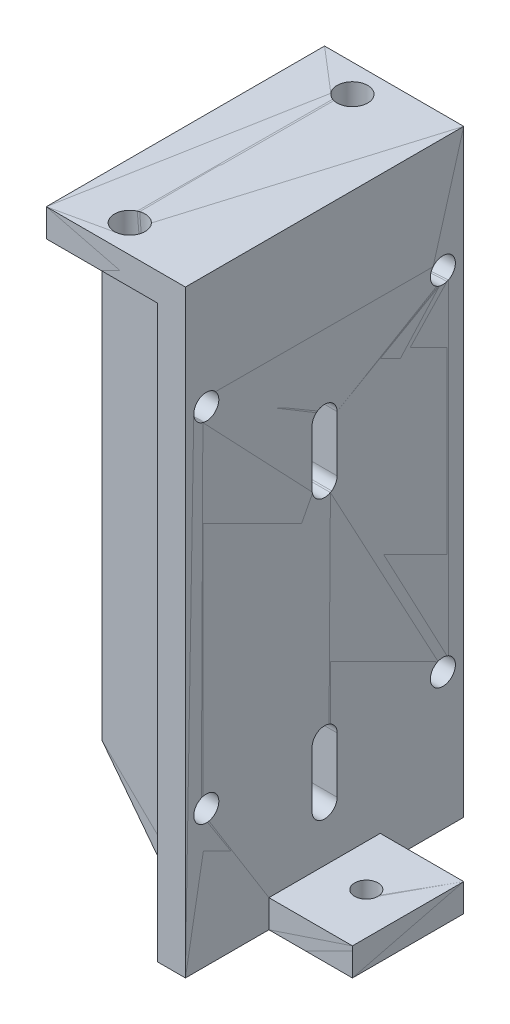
ISO-10303-21;
HEADER;
FILE_DESCRIPTION(('STEP AP214'),'2;1');
FILE_NAME('part.step','',(''),(''),'','','');
FILE_SCHEMA(('AUTOMOTIVE_DESIGN { 1 0 10303 214 1 1 1 1 }'));
ENDSEC;
DATA;
#1=APPLICATION_CONTEXT('core data for automotive mechanical design processes');
#2=APPLICATION_PROTOCOL_DEFINITION('international standard','automotive_design',2000,#1);
#3=PRODUCT_CONTEXT('',#1,'mechanical');
#4=PRODUCT('Part','Part','',(#3));
#5=PRODUCT_RELATED_PRODUCT_CATEGORY('part','',(#4));
#6=PRODUCT_DEFINITION_FORMATION('','',#4);
#7=PRODUCT_DEFINITION_CONTEXT('part definition',#1,'design');
#8=PRODUCT_DEFINITION('design','',#6,#7);
#9=PRODUCT_DEFINITION_SHAPE('','',#8);
#10=(LENGTH_UNIT() NAMED_UNIT(*) SI_UNIT(.MILLI.,.METRE.));
#11=(NAMED_UNIT(*) PLANE_ANGLE_UNIT() SI_UNIT($,.RADIAN.));
#12=(NAMED_UNIT(*) SI_UNIT($,.STERADIAN.) SOLID_ANGLE_UNIT());
#13=UNCERTAINTY_MEASURE_WITH_UNIT(LENGTH_MEASURE(1.E-05),#10,'distance_accuracy_value','');
#14=(GEOMETRIC_REPRESENTATION_CONTEXT(3) GLOBAL_UNCERTAINTY_ASSIGNED_CONTEXT((#13)) GLOBAL_UNIT_ASSIGNED_CONTEXT((#10,
#11,#12)) REPRESENTATION_CONTEXT('',''));
#15=CARTESIAN_POINT('',(0.,0.,0.));
#16=DIRECTION('',(0.,0.,1.));
#17=DIRECTION('',(1.,0.,0.));
#18=AXIS2_PLACEMENT_3D('',#15,#16,#17);
#19=CARTESIAN_POINT('',(41.093747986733,-180.62499958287,20.));
#20=DIRECTION('',(1.,0.,0.));
#21=DIRECTION('',(0.,0.,-1.));
#22=AXIS2_PLACEMENT_3D('',#19,#20,#21);
#23=PLANE('',#22);
#24=DIRECTION('',(0.,0.,-1.));
#25=VECTOR('',#24,1.);
#26=CARTESIAN_POINT('',(41.093747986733,-170.62499958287,0.));
#27=LINE('',#26,#25);
#28=CARTESIAN_POINT('',(41.093747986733,-170.62499958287,20.));
#29=VERTEX_POINT('',#28);
#30=CARTESIAN_POINT('',(41.093747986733,-170.62499958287,-20.));
#31=VERTEX_POINT('',#30);
#32=EDGE_CURVE('P0_E706',#29,#31,#27,.T.);
#33=ORIENTED_EDGE('',*,*,#32,.F.);
#34=DIRECTION('',(0.,1.,0.));
#35=VECTOR('',#34,1.);
#36=CARTESIAN_POINT('',(41.093747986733,-185.62499958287,20.));
#37=LINE('',#36,#35);
#38=CARTESIAN_POINT('',(41.0937479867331,-180.62499958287,20.));
#39=VERTEX_POINT('',#38);
#40=EDGE_CURVE('P0_E703',#39,#29,#37,.T.);
#41=ORIENTED_EDGE('',*,*,#40,.F.);
#42=DIRECTION('',(0.,0.,1.));
#43=VECTOR('',#42,1.);
#44=CARTESIAN_POINT('',(41.0937479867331,-180.62499958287,0.));
#45=LINE('',#44,#43);
#46=CARTESIAN_POINT('',(41.093747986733,-180.62499958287,-20.));
#47=VERTEX_POINT('',#46);
#48=EDGE_CURVE('P0_E506',#47,#39,#45,.T.);
#49=ORIENTED_EDGE('',*,*,#48,.F.);
#50=DIRECTION('',(0.,-1.,0.));
#51=VECTOR('',#50,1.);
#52=CARTESIAN_POINT('',(41.093747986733,-165.62499958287,-20.));
#53=LINE('',#52,#51);
#54=EDGE_CURVE('P0_E502',#31,#47,#53,.T.);
#55=ORIENTED_EDGE('',*,*,#54,.F.);
#56=EDGE_LOOP('',(#33,#41,#49,#55));
#57=FACE_BOUND('',#56,.T.);
#58=ADVANCED_FACE('P0_F348',(#57),#23,.T.);
#59=CARTESIAN_POINT('',(26.093747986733,-180.62499958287,0.));
#60=DIRECTION('',(0.,1.,0.));
#61=DIRECTION('',(0.,0.,1.));
#62=AXIS2_PLACEMENT_3D('',#59,#60,#61);
#63=CYLINDRICAL_SURFACE('',#62,4.1999999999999);
#64=CARTESIAN_POINT('',(26.093747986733,-180.62499958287,0.));
#65=DIRECTION('',(0.,1.,0.));
#66=DIRECTION('',(0.,0.,1.));
#67=AXIS2_PLACEMENT_3D('',#64,#65,#66);
#68=CIRCLE('',#67,4.1999999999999);
#69=CARTESIAN_POINT('',(26.093747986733,-180.62499958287,4.1999999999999));
#70=VERTEX_POINT('',#69);
#71=EDGE_CURVE('P0_E668',#70,#70,#68,.T.);
#72=ORIENTED_EDGE('',*,*,#71,.F.);
#73=EDGE_LOOP('',(#72));
#74=FACE_BOUND('',#73,.T.);
#75=CARTESIAN_POINT('',(26.093747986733,-170.62499958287,0.));
#76=DIRECTION('',(0.,1.,0.));
#77=DIRECTION('',(0.,0.,1.));
#78=AXIS2_PLACEMENT_3D('',#75,#76,#77);
#79=CIRCLE('',#78,4.1999999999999);
#80=CARTESIAN_POINT('',(26.093747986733,-170.62499958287,4.1999999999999));
#81=VERTEX_POINT('',#80);
#82=EDGE_CURVE('P0_E664',#81,#81,#79,.F.);
#83=ORIENTED_EDGE('',*,*,#82,.F.);
#84=EDGE_LOOP('',(#83));
#85=FACE_BOUND('',#84,.T.);
#86=ADVANCED_FACE('P0_F895',(#74,#85),#63,.F.);
#87=CARTESIAN_POINT('',(1.0937479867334,24.375000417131,50.));
#88=DIRECTION('',(-1.,0.,0.));
#89=DIRECTION('',(0.,0.,-1.));
#90=AXIS2_PLACEMENT_3D('',#87,#88,#89);
#91=PLANE('',#90);
#92=CARTESIAN_POINT('',(1.0937479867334,-31.624999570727,0.));
#93=DIRECTION('',(1.,0.,0.));
#94=DIRECTION('',(0.,0.,-1.));
#95=AXIS2_PLACEMENT_3D('',#92,#93,#94);
#96=CIRCLE('',#95,4.50000000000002);
#97=CARTESIAN_POINT('',(1.0937479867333,-31.6249993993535,4.5));
#98=VERTEX_POINT('',#97);
#99=CARTESIAN_POINT('',(1.09374798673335,-31.6249997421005,-4.5));
#100=VERTEX_POINT('',#99);
#101=EDGE_CURVE('P0_E551',#98,#100,#96,.F.);
#102=ORIENTED_EDGE('',*,*,#101,.F.);
#103=DIRECTION('',(0.,-1.,0.));
#104=VECTOR('',#103,1.);
#105=CARTESIAN_POINT('',(1.0937479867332,-41.6249994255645,4.5));
#106=LINE('',#105,#104);
#107=CARTESIAN_POINT('',(1.0937479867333,-51.624999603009,4.5));
#108=VERTEX_POINT('',#107);
#109=EDGE_CURVE('P0_E557',#98,#108,#106,.T.);
#110=ORIENTED_EDGE('',*,*,#109,.T.);
#111=CARTESIAN_POINT('',(1.0937479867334,-51.624999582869,0.));
#112=DIRECTION('',(1.,0.,0.));
#113=DIRECTION('',(0.,0.,-1.));
#114=AXIS2_PLACEMENT_3D('',#111,#112,#113);
#115=CIRCLE('',#114,4.5);
#116=CARTESIAN_POINT('',(1.09374798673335,-51.6249996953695,-4.5));
#117=VERTEX_POINT('',#116);
#118=EDGE_CURVE('P0_E560',#117,#108,#115,.F.);
#119=ORIENTED_EDGE('',*,*,#118,.F.);
#120=DIRECTION('',(0.,1.,0.));
#121=VECTOR('',#120,1.);
#122=CARTESIAN_POINT('',(1.0937479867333,-41.624999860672,-4.5));
#123=LINE('',#122,#121);
#124=EDGE_CURVE('P0_E547',#117,#100,#123,.T.);
#125=ORIENTED_EDGE('',*,*,#124,.T.);
#126=EDGE_LOOP('',(#102,#110,#119,#125));
#127=FACE_BOUND('',#126,.T.);
#128=CARTESIAN_POINT('',(1.0937479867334,-131.62499958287,0.));
#129=DIRECTION('',(1.,0.,0.));
#130=DIRECTION('',(0.,0.,-1.));
#131=AXIS2_PLACEMENT_3D('',#128,#129,#130);
#132=CIRCLE('',#131,4.5);
#133=CARTESIAN_POINT('',(1.09374798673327,-131.62499958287,4.5));
#134=VERTEX_POINT('',#133);
#135=CARTESIAN_POINT('',(1.09374798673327,-131.62499958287,-4.5));
#136=VERTEX_POINT('',#135);
#137=EDGE_CURVE('P0_E565',#134,#136,#132,.F.);
#138=ORIENTED_EDGE('',*,*,#137,.F.);
#139=DIRECTION('',(0.,-1.,0.));
#140=VECTOR('',#139,1.);
#141=CARTESIAN_POINT('',(1.09374798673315,-141.62499958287,4.5));
#142=LINE('',#141,#140);
#143=CARTESIAN_POINT('',(1.09374798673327,-151.62499958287,4.5));
#144=VERTEX_POINT('',#143);
#145=EDGE_CURVE('P0_E571',#134,#144,#142,.T.);
#146=ORIENTED_EDGE('',*,*,#145,.T.);
#147=CARTESIAN_POINT('',(1.0937479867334,-151.62499958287,0.));
#148=DIRECTION('',(1.,0.,0.));
#149=DIRECTION('',(0.,0.,-1.));
#150=AXIS2_PLACEMENT_3D('',#147,#148,#149);
#151=CIRCLE('',#150,4.5);
#152=CARTESIAN_POINT('',(1.09374798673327,-151.62499958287,-4.5));
#153=VERTEX_POINT('',#152);
#154=EDGE_CURVE('P0_E576',#153,#144,#151,.F.);
#155=ORIENTED_EDGE('',*,*,#154,.F.);
#156=DIRECTION('',(0.,1.,0.));
#157=VECTOR('',#156,1.);
#158=CARTESIAN_POINT('',(1.09374798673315,-141.62499958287,-4.5));
#159=LINE('',#158,#157);
#160=EDGE_CURVE('P0_E561',#153,#136,#159,.T.);
#161=ORIENTED_EDGE('',*,*,#160,.T.);
#162=EDGE_LOOP('',(#138,#146,#155,#161));
#163=FACE_BOUND('',#162,.T.);
#164=DIRECTION('',(0.,0.,-1.));
#165=VECTOR('',#164,1.);
#166=CARTESIAN_POINT('',(1.09374798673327,-180.62499958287,0.));
#167=LINE('',#166,#165);
#168=CARTESIAN_POINT('',(1.09374798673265,-180.62499958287,24.9999999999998));
#169=VERTEX_POINT('',#168);
#170=CARTESIAN_POINT('',(1.09374798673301,-180.62499958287,-25.0000000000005));
#171=VERTEX_POINT('',#170);
#172=EDGE_CURVE('P0_E592',#169,#171,#167,.T.);
#173=ORIENTED_EDGE('',*,*,#172,.F.);
#174=DIRECTION('',(0.,-1.,0.));
#175=VECTOR('',#174,1.);
#176=CARTESIAN_POINT('',(1.09374798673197,-78.1249995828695,25.));
#177=LINE('',#176,#175);
#178=CARTESIAN_POINT('',(1.09374798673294,24.375000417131,24.9999999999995));
#179=VERTEX_POINT('',#178);
#180=EDGE_CURVE('P0_E688',#179,#169,#177,.T.);
#181=ORIENTED_EDGE('',*,*,#180,.F.);
#182=DIRECTION('',(0.,0.,1.));
#183=VECTOR('',#182,1.);
#184=CARTESIAN_POINT('',(1.093747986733,24.375000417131,0.));
#185=LINE('',#184,#183);
#186=CARTESIAN_POINT('',(1.09374798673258,24.375000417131,-25.0000000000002));
#187=VERTEX_POINT('',#186);
#188=EDGE_CURVE('P0_E815',#187,#179,#185,.T.);
#189=ORIENTED_EDGE('',*,*,#188,.F.);
#190=DIRECTION('',(0.,1.,0.));
#191=VECTOR('',#190,1.);
#192=CARTESIAN_POINT('',(1.09374798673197,-78.1249995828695,-25.));
#193=LINE('',#192,#191);
#194=EDGE_CURVE('P0_E826',#171,#187,#193,.T.);
#195=ORIENTED_EDGE('',*,*,#194,.F.);
#196=EDGE_LOOP('',(#173,#181,#189,#195));
#197=FACE_BOUND('',#196,.T.);
#198=ADVANCED_FACE('P0_F857',(#127,#163,#197),#91,.T.);
#199=CARTESIAN_POINT('',(1.0937479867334,24.375000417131,50.));
#200=DIRECTION('',(-1.,0.,0.));
#201=DIRECTION('',(0.,0.,-1.));
#202=AXIS2_PLACEMENT_3D('',#199,#200,#201);
#203=PLANE('',#202);
#204=CARTESIAN_POINT('',(1.0937479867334,-131.62499958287,-42.5));
#205=DIRECTION('',(1.,0.,0.));
#206=DIRECTION('',(0.,0.,-1.));
#207=AXIS2_PLACEMENT_3D('',#204,#205,#206);
#208=CIRCLE('',#207,4.49999999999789);
#209=CARTESIAN_POINT('',(1.0937479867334,-131.62499958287,-46.9999999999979));
#210=VERTEX_POINT('',#209);
#211=EDGE_CURVE('P0_E658',#210,#210,#208,.F.);
#212=ORIENTED_EDGE('',*,*,#211,.F.);
#213=EDGE_LOOP('',(#212));
#214=FACE_BOUND('',#213,.T.);
#215=CARTESIAN_POINT('',(1.0937479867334,-6.6249995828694,-42.5));
#216=DIRECTION('',(1.,0.,0.));
#217=DIRECTION('',(0.,0.,-1.));
#218=AXIS2_PLACEMENT_3D('',#215,#216,#217);
#219=CIRCLE('',#218,4.50000000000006);
#220=CARTESIAN_POINT('',(1.0937479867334,-6.6249995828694,-47.0000000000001));
#221=VERTEX_POINT('',#220);
#222=EDGE_CURVE('P0_E661',#221,#221,#219,.F.);
#223=ORIENTED_EDGE('',*,*,#222,.F.);
#224=EDGE_LOOP('',(#223));
#225=FACE_BOUND('',#224,.T.);
#226=DIRECTION('',(0.,0.,-1.));
#227=VECTOR('',#226,1.);
#228=CARTESIAN_POINT('',(1.09374798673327,-180.62499958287,0.));
#229=LINE('',#228,#227);
#230=CARTESIAN_POINT('',(1.09374798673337,-180.62499958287,-29.9999999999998));
#231=VERTEX_POINT('',#230);
#232=CARTESIAN_POINT('',(1.09374798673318,-180.62499958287,-50.));
#233=VERTEX_POINT('',#232);
#234=EDGE_CURVE('P0_E507',#231,#233,#229,.T.);
#235=ORIENTED_EDGE('',*,*,#234,.F.);
#236=DIRECTION('',(0.,-1.,0.));
#237=VECTOR('',#236,1.);
#238=CARTESIAN_POINT('',(1.0937479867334,-78.1249995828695,-30.));
#239=LINE('',#238,#237);
#240=CARTESIAN_POINT('',(1.0937479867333,24.375000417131,-29.9999999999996));
#241=VERTEX_POINT('',#240);
#242=EDGE_CURVE('P0_E832',#241,#231,#239,.T.);
#243=ORIENTED_EDGE('',*,*,#242,.F.);
#244=DIRECTION('',(0.,0.,1.));
#245=VECTOR('',#244,1.);
#246=CARTESIAN_POINT('',(1.093747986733,24.375000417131,0.));
#247=LINE('',#246,#245);
#248=CARTESIAN_POINT('',(1.09374798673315,24.3750004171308,-50.));
#249=VERTEX_POINT('',#248);
#250=EDGE_CURVE('P0_E717',#249,#241,#247,.T.);
#251=ORIENTED_EDGE('',*,*,#250,.F.);
#252=DIRECTION('',(0.,1.,0.));
#253=VECTOR('',#252,1.);
#254=CARTESIAN_POINT('',(1.0937479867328,-73.1249995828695,-50.));
#255=LINE('',#254,#253);
#256=EDGE_CURVE('P0_E727',#233,#249,#255,.T.);
#257=ORIENTED_EDGE('',*,*,#256,.F.);
#258=EDGE_LOOP('',(#235,#243,#251,#257));
#259=FACE_BOUND('',#258,.T.);
#260=ADVANCED_FACE('P0_F842',(#214,#225,#259),#203,.T.);
#261=CARTESIAN_POINT('',(1.0937479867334,-180.62499958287,-30.));
#262=DIRECTION('',(0.,0.,-1.));
#263=DIRECTION('',(-1.,0.,0.));
#264=AXIS2_PLACEMENT_3D('',#261,#262,#263);
#265=PLANE('',#264);
#266=DIRECTION('',(0.,-1.,0.));
#267=VECTOR('',#266,1.);
#268=CARTESIAN_POINT('',(-38.906252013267,-53.6249995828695,-29.9999999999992));
#269=LINE('',#268,#267);
#270=CARTESIAN_POINT('',(-38.9062520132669,24.375000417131,-29.9999999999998));
#271=VERTEX_POINT('',#270);
#272=CARTESIAN_POINT('',(-38.9062520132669,-141.62499958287,-29.9999999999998));
#273=VERTEX_POINT('',#272);
#274=EDGE_CURVE('P0_E584',#271,#273,#269,.T.);
#275=ORIENTED_EDGE('',*,*,#274,.F.);
#276=DIRECTION('',(-1.,0.,0.));
#277=VECTOR('',#276,1.);
#278=CARTESIAN_POINT('',(11.093747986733,24.375000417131,-30.));
#279=LINE('',#278,#277);
#280=EDGE_CURVE('P0_E720',#241,#271,#279,.T.);
#281=ORIENTED_EDGE('',*,*,#280,.F.);
#282=ORIENTED_EDGE('',*,*,#242,.T.);
#283=DIRECTION('',(1.,0.,0.));
#284=VECTOR('',#283,1.);
#285=CARTESIAN_POINT('',(41.0937479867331,-180.62499958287,-30.));
#286=LINE('',#285,#284);
#287=CARTESIAN_POINT('',(-8.90625201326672,-180.62499958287,-30.));
#288=VERTEX_POINT('',#287);
#289=EDGE_CURVE('P0_E588',#288,#231,#286,.T.);
#290=ORIENTED_EDGE('',*,*,#289,.F.);
#291=DIRECTION('',(0.609710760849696,-0.792623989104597,0.));
#292=VECTOR('',#291,1.);
#293=CARTESIAN_POINT('',(-23.9062520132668,-161.12499958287,-30.));
#294=LINE('',#293,#292);
#295=EDGE_CURVE('P0_E460',#273,#288,#294,.T.);
#296=ORIENTED_EDGE('',*,*,#295,.F.);
#297=EDGE_LOOP('',(#275,#281,#282,#290,#296));
#298=FACE_BOUND('',#297,.T.);
#299=ADVANCED_FACE('P0_F837',(#298),#265,.T.);
#300=CARTESIAN_POINT('',(-8.9062520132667,-180.62499958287,-30.));
#301=DIRECTION('',(-0.792623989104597,-0.609710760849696,0.));
#302=DIRECTION('',(0.,0.,1.));
#303=AXIS2_PLACEMENT_3D('',#300,#301,#302);
#304=PLANE('',#303);
#305=DIRECTION('',(0.609710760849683,-0.792623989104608,0.));
#306=VECTOR('',#305,1.);
#307=CARTESIAN_POINT('',(-38.906252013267,-141.624999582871,-25.));
#308=LINE('',#307,#306);
#309=CARTESIAN_POINT('',(-38.906252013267,-141.62499958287,-24.9999999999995));
#310=VERTEX_POINT('',#309);
#311=CARTESIAN_POINT('',(-8.90625201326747,-180.62499958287,-25.));
#312=VERTEX_POINT('',#311);
#313=EDGE_CURVE('P0_E352',#310,#312,#308,.T.);
#314=ORIENTED_EDGE('',*,*,#313,.F.);
#315=DIRECTION('',(0.,0.,1.));
#316=VECTOR('',#315,1.);
#317=CARTESIAN_POINT('',(-38.906252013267,-141.62499958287,-38.));
#318=LINE('',#317,#316);
#319=EDGE_CURVE('P0_E581',#273,#310,#318,.T.);
#320=ORIENTED_EDGE('',*,*,#319,.F.);
#321=ORIENTED_EDGE('',*,*,#295,.T.);
#322=DIRECTION('',(0.,0.,-1.));
#323=VECTOR('',#322,1.);
#324=CARTESIAN_POINT('',(-8.9062520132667,-180.62499958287,0.));
#325=LINE('',#324,#323);
#326=EDGE_CURVE('P0_E585',#312,#288,#325,.T.);
#327=ORIENTED_EDGE('',*,*,#326,.F.);
#328=EDGE_LOOP('',(#314,#320,#321,#327));
#329=FACE_BOUND('',#328,.T.);
#330=ADVANCED_FACE('P0_F844',(#329),#304,.T.);
#331=CARTESIAN_POINT('',(-38.906252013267,-180.62499958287,-25.));
#332=DIRECTION('',(0.,0.,1.));
#333=DIRECTION('',(1.,0.,0.));
#334=AXIS2_PLACEMENT_3D('',#331,#332,#333);
#335=PLANE('',#334);
#336=DIRECTION('',(-1.,0.,0.));
#337=VECTOR('',#336,1.);
#338=CARTESIAN_POINT('',(41.0937479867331,-180.62499958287,-25.));
#339=LINE('',#338,#337);
#340=EDGE_CURVE('P0_E589',#171,#312,#339,.T.);
#341=ORIENTED_EDGE('',*,*,#340,.F.);
#342=ORIENTED_EDGE('',*,*,#194,.T.);
#343=DIRECTION('',(1.,0.,0.));
#344=VECTOR('',#343,1.);
#345=CARTESIAN_POINT('',(11.093747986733,24.375000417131,-25.));
#346=LINE('',#345,#344);
#347=CARTESIAN_POINT('',(-38.906252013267,24.375000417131,-24.9999999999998));
#348=VERTEX_POINT('',#347);
#349=EDGE_CURVE('P0_E823',#348,#187,#346,.T.);
#350=ORIENTED_EDGE('',*,*,#349,.F.);
#351=DIRECTION('',(0.,1.,0.));
#352=VECTOR('',#351,1.);
#353=CARTESIAN_POINT('',(-38.906252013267,-53.6249995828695,-24.9999999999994));
#354=LINE('',#353,#352);
#355=EDGE_CURVE('P0_E577',#310,#348,#354,.T.);
#356=ORIENTED_EDGE('',*,*,#355,.F.);
#357=ORIENTED_EDGE('',*,*,#313,.T.);
#358=EDGE_LOOP('',(#341,#342,#350,#356,#357));
#359=FACE_BOUND('',#358,.T.);
#360=ADVANCED_FACE('P0_F821',(#359),#335,.T.);
#361=CARTESIAN_POINT('',(-38.906252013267,24.375000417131,50.));
#362=DIRECTION('',(0.,-1.,0.));
#363=DIRECTION('',(0.,0.,-1.));
#364=AXIS2_PLACEMENT_3D('',#361,#362,#363);
#365=PLANE('',#364);
#366=ORIENTED_EDGE('',*,*,#188,.T.);
#367=DIRECTION('',(1.,0.,0.));
#368=VECTOR('',#367,1.);
#369=CARTESIAN_POINT('',(63.5937479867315,24.375000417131,25.));
#370=LINE('',#369,#368);
#371=CARTESIAN_POINT('',(-38.906252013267,24.375000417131,25.0000000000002));
#372=VERTEX_POINT('',#371);
#373=EDGE_CURVE('P0_E681',#372,#179,#370,.T.);
#374=ORIENTED_EDGE('',*,*,#373,.F.);
#375=DIRECTION('',(0.,0.,1.));
#376=VECTOR('',#375,1.);
#377=CARTESIAN_POINT('',(-38.906252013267,24.3750004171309,-38.));
#378=LINE('',#377,#376);
#379=EDGE_CURVE('P0_E580',#348,#372,#378,.T.);
#380=ORIENTED_EDGE('',*,*,#379,.F.);
#381=ORIENTED_EDGE('',*,*,#349,.T.);
#382=EDGE_LOOP('',(#366,#374,#380,#381));
#383=FACE_BOUND('',#382,.T.);
#384=ADVANCED_FACE('P0_F811',(#383),#365,.T.);
#385=CARTESIAN_POINT('',(-38.906252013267,24.375000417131,25.));
#386=DIRECTION('',(0.,0.,-1.));
#387=DIRECTION('',(1.,0.,0.));
#388=AXIS2_PLACEMENT_3D('',#385,#386,#387);
#389=PLANE('',#388);
#390=DIRECTION('',(0.,-1.,0.));
#391=VECTOR('',#390,1.);
#392=CARTESIAN_POINT('',(-38.906252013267,-53.6249995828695,25.0000000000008));
#393=LINE('',#392,#391);
#394=CARTESIAN_POINT('',(-38.906252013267,-141.62499958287,25.0000000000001));
#395=VERTEX_POINT('',#394);
#396=EDGE_CURVE('P0_E600',#372,#395,#393,.T.);
#397=ORIENTED_EDGE('',*,*,#396,.F.);
#398=ORIENTED_EDGE('',*,*,#373,.T.);
#399=ORIENTED_EDGE('',*,*,#180,.T.);
#400=DIRECTION('',(1.,0.,0.));
#401=VECTOR('',#400,1.);
#402=CARTESIAN_POINT('',(41.0937479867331,-180.62499958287,25.));
#403=LINE('',#402,#401);
#404=CARTESIAN_POINT('',(-8.90625201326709,-180.62499958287,24.9999999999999));
#405=VERTEX_POINT('',#404);
#406=EDGE_CURVE('P0_E604',#405,#169,#403,.T.);
#407=ORIENTED_EDGE('',*,*,#406,.F.);
#408=DIRECTION('',(0.609710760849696,-0.792623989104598,0.));
#409=VECTOR('',#408,1.);
#410=CARTESIAN_POINT('',(-23.9062520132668,-161.12499958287,24.9999999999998));
#411=LINE('',#410,#409);
#412=EDGE_CURVE('P0_E673',#395,#405,#411,.T.);
#413=ORIENTED_EDGE('',*,*,#412,.F.);
#414=EDGE_LOOP('',(#397,#398,#399,#407,#413));
#415=FACE_BOUND('',#414,.T.);
#416=ADVANCED_FACE('P0_F818',(#415),#389,.T.);
#417=CARTESIAN_POINT('',(-38.906252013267,-141.62499958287,30.));
#418=DIRECTION('',(-0.792623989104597,-0.609710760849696,0.));
#419=DIRECTION('',(0.,0.,-1.));
#420=AXIS2_PLACEMENT_3D('',#417,#418,#419);
#421=PLANE('',#420);
#422=DIRECTION('',(0.,0.,-1.));
#423=VECTOR('',#422,1.);
#424=CARTESIAN_POINT('',(-8.9062520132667,-180.62499958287,0.));
#425=LINE('',#424,#423);
#426=CARTESIAN_POINT('',(-8.90625201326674,-180.62499958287,30.));
#427=VERTEX_POINT('',#426);
#428=EDGE_CURVE('P0_E601',#427,#405,#425,.T.);
#429=ORIENTED_EDGE('',*,*,#428,.F.);
#430=DIRECTION('',(0.6097107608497,-0.792623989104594,0.));
#431=VECTOR('',#430,1.);
#432=CARTESIAN_POINT('',(-38.9062520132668,-141.624999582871,30.));
#433=LINE('',#432,#431);
#434=CARTESIAN_POINT('',(-38.9062520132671,-141.62499958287,30.0000000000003));
#435=VERTEX_POINT('',#434);
#436=EDGE_CURVE('P0_E671',#435,#427,#433,.T.);
#437=ORIENTED_EDGE('',*,*,#436,.F.);
#438=DIRECTION('',(0.,0.,1.));
#439=VECTOR('',#438,1.);
#440=CARTESIAN_POINT('',(-38.906252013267,-141.62499958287,-38.));
#441=LINE('',#440,#439);
#442=EDGE_CURVE('P0_E597',#395,#435,#441,.T.);
#443=ORIENTED_EDGE('',*,*,#442,.F.);
#444=ORIENTED_EDGE('',*,*,#412,.T.);
#445=EDGE_LOOP('',(#429,#437,#443,#444));
#446=FACE_BOUND('',#445,.T.);
#447=ADVANCED_FACE('P0_F858',(#446),#421,.T.);
#448=CARTESIAN_POINT('',(1.0937479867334,24.375000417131,30.));
#449=DIRECTION('',(0.,0.,1.));
#450=DIRECTION('',(-1.,0.,0.));
#451=AXIS2_PLACEMENT_3D('',#448,#449,#450);
#452=PLANE('',#451);
#453=ORIENTED_EDGE('',*,*,#436,.T.);
#454=DIRECTION('',(-1.,0.,0.));
#455=VECTOR('',#454,1.);
#456=CARTESIAN_POINT('',(41.0937479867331,-180.62499958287,30.));
#457=LINE('',#456,#455);
#458=CARTESIAN_POINT('',(1.09374798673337,-180.62499958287,30.));
#459=VERTEX_POINT('',#458);
#460=EDGE_CURVE('P0_E605',#459,#427,#457,.T.);
#461=ORIENTED_EDGE('',*,*,#460,.F.);
#462=DIRECTION('',(0.,-1.,0.));
#463=VECTOR('',#462,1.);
#464=CARTESIAN_POINT('',(1.0937479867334,-78.1249995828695,30.));
#465=LINE('',#464,#463);
#466=CARTESIAN_POINT('',(1.0937479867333,24.375000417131,30.));
#467=VERTEX_POINT('',#466);
#468=EDGE_CURVE('P0_E672',#467,#459,#465,.T.);
#469=ORIENTED_EDGE('',*,*,#468,.F.);
#470=DIRECTION('',(1.,0.,0.));
#471=VECTOR('',#470,1.);
#472=CARTESIAN_POINT('',(11.093747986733,24.375000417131,30.));
#473=LINE('',#472,#471);
#474=CARTESIAN_POINT('',(-38.9062520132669,24.375000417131,30.0000000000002));
#475=VERTEX_POINT('',#474);
#476=EDGE_CURVE('P0_E647',#475,#467,#473,.T.);
#477=ORIENTED_EDGE('',*,*,#476,.F.);
#478=DIRECTION('',(0.,1.,0.));
#479=VECTOR('',#478,1.);
#480=CARTESIAN_POINT('',(-38.906252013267,-53.6249995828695,30.0000000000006));
#481=LINE('',#480,#479);
#482=EDGE_CURVE('P0_E593',#435,#475,#481,.T.);
#483=ORIENTED_EDGE('',*,*,#482,.F.);
#484=EDGE_LOOP('',(#453,#461,#469,#477,#483));
#485=FACE_BOUND('',#484,.T.);
#486=ADVANCED_FACE('P0_F859',(#485),#452,.T.);
#487=CARTESIAN_POINT('',(1.0937479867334,24.375000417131,50.));
#488=DIRECTION('',(-1.,0.,0.));
#489=DIRECTION('',(0.,0.,-1.));
#490=AXIS2_PLACEMENT_3D('',#487,#488,#489);
#491=PLANE('',#490);
#492=CARTESIAN_POINT('',(1.0937479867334,-131.62499958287,42.5));
#493=DIRECTION('',(1.,0.,0.));
#494=DIRECTION('',(0.,0.,-1.));
#495=AXIS2_PLACEMENT_3D('',#492,#493,#494);
#496=CIRCLE('',#495,4.49999999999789);
#497=CARTESIAN_POINT('',(1.0937479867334,-131.62499958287,38.0000000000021));
#498=VERTEX_POINT('',#497);
#499=EDGE_CURVE('P0_E644',#498,#498,#496,.F.);
#500=ORIENTED_EDGE('',*,*,#499,.F.);
#501=EDGE_LOOP('',(#500));
#502=FACE_BOUND('',#501,.T.);
#503=CARTESIAN_POINT('',(1.0937479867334,-6.6249995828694,42.5));
#504=DIRECTION('',(1.,0.,0.));
#505=DIRECTION('',(0.,0.,-1.));
#506=AXIS2_PLACEMENT_3D('',#503,#504,#505);
#507=CIRCLE('',#506,4.50000000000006);
#508=CARTESIAN_POINT('',(1.0937479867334,-6.6249995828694,37.9999999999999));
#509=VERTEX_POINT('',#508);
#510=EDGE_CURVE('P0_E546',#509,#509,#507,.F.);
#511=ORIENTED_EDGE('',*,*,#510,.F.);
#512=EDGE_LOOP('',(#511));
#513=FACE_BOUND('',#512,.T.);
#514=DIRECTION('',(0.,0.,-1.));
#515=VECTOR('',#514,1.);
#516=CARTESIAN_POINT('',(1.09374798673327,-180.62499958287,0.));
#517=LINE('',#516,#515);
#518=CARTESIAN_POINT('',(1.09374798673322,-180.62499958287,50.));
#519=VERTEX_POINT('',#518);
#520=EDGE_CURVE('P0_E607',#519,#459,#517,.T.);
#521=ORIENTED_EDGE('',*,*,#520,.F.);
#522=DIRECTION('',(0.,-1.,0.));
#523=VECTOR('',#522,1.);
#524=CARTESIAN_POINT('',(1.0937479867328,-73.1249995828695,50.));
#525=LINE('',#524,#523);
#526=CARTESIAN_POINT('',(1.09374798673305,24.375000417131,50.));
#527=VERTEX_POINT('',#526);
#528=EDGE_CURVE('P0_E527',#527,#519,#525,.T.);
#529=ORIENTED_EDGE('',*,*,#528,.F.);
#530=DIRECTION('',(0.,0.,1.));
#531=VECTOR('',#530,1.);
#532=CARTESIAN_POINT('',(1.093747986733,24.375000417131,0.));
#533=LINE('',#532,#531);
#534=EDGE_CURVE('P0_E715',#467,#527,#533,.T.);
#535=ORIENTED_EDGE('',*,*,#534,.F.);
#536=ORIENTED_EDGE('',*,*,#468,.T.);
#537=EDGE_LOOP('',(#521,#529,#535,#536));
#538=FACE_BOUND('',#537,.T.);
#539=ADVANCED_FACE('P0_F779',(#502,#513,#538),#491,.T.);
#540=CARTESIAN_POINT('',(41.093747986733,-180.62499958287,-20.));
#541=DIRECTION('',(0.,0.,-1.));
#542=DIRECTION('',(-1.,0.,0.));
#543=AXIS2_PLACEMENT_3D('',#540,#541,#542);
#544=PLANE('',#543);
#545=DIRECTION('',(0.,-1.,0.));
#546=VECTOR('',#545,1.);
#547=CARTESIAN_POINT('',(11.093747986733,-73.1249995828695,-20.0000000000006));
#548=LINE('',#547,#546);
#549=CARTESIAN_POINT('',(11.0937479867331,-170.62499958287,-20.0000000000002));
#550=VERTEX_POINT('',#549);
#551=CARTESIAN_POINT('',(11.0937479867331,-180.62499958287,-20.0000000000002));
#552=VERTEX_POINT('',#551);
#553=EDGE_CURVE('P0_E493',#550,#552,#548,.T.);
#554=ORIENTED_EDGE('',*,*,#553,.F.);
#555=DIRECTION('',(-1.,0.,0.));
#556=VECTOR('',#555,1.);
#557=CARTESIAN_POINT('',(21.0937479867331,-170.62499958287,-20.));
#558=LINE('',#557,#556);
#559=EDGE_CURVE('P0_E711',#31,#550,#558,.T.);
#560=ORIENTED_EDGE('',*,*,#559,.F.);
#561=ORIENTED_EDGE('',*,*,#54,.T.);
#562=DIRECTION('',(1.,0.,0.));
#563=VECTOR('',#562,1.);
#564=CARTESIAN_POINT('',(41.0937479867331,-180.62499958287,-20.));
#565=LINE('',#564,#563);
#566=EDGE_CURVE('P0_E497',#552,#47,#565,.T.);
#567=ORIENTED_EDGE('',*,*,#566,.F.);
#568=EDGE_LOOP('',(#554,#560,#561,#567));
#569=FACE_BOUND('',#568,.T.);
#570=ADVANCED_FACE('P0_F499',(#569),#544,.T.);
#571=CARTESIAN_POINT('',(-8.9062520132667,-180.62499958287,50.));
#572=DIRECTION('',(0.,-1.,0.));
#573=DIRECTION('',(0.,0.,-1.));
#574=AXIS2_PLACEMENT_3D('',#571,#572,#573);
#575=PLANE('',#574);
#576=ORIENTED_EDGE('',*,*,#71,.T.);
#577=EDGE_LOOP('',(#576));
#578=FACE_BOUND('',#577,.T.);
#579=ORIENTED_EDGE('',*,*,#48,.T.);
#580=DIRECTION('',(1.,0.,0.));
#581=VECTOR('',#580,1.);
#582=CARTESIAN_POINT('',(26.093747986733,-180.62499958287,20.));
#583=LINE('',#582,#581);
#584=CARTESIAN_POINT('',(11.0937479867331,-180.62499958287,20.));
#585=VERTEX_POINT('',#584);
#586=EDGE_CURVE('P0_E670',#585,#39,#583,.T.);
#587=ORIENTED_EDGE('',*,*,#586,.F.);
#588=DIRECTION('',(0.,0.,-1.));
#589=VECTOR('',#588,1.);
#590=CARTESIAN_POINT('',(11.093747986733,-180.62499958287,-57.5));
#591=LINE('',#590,#589);
#592=CARTESIAN_POINT('',(11.0937479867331,-180.62499958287,50.));
#593=VERTEX_POINT('',#592);
#594=EDGE_CURVE('P0_E762',#593,#585,#591,.T.);
#595=ORIENTED_EDGE('',*,*,#594,.F.);
#596=DIRECTION('',(1.,0.,0.));
#597=VECTOR('',#596,1.);
#598=CARTESIAN_POINT('',(-96.4062520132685,-180.62499958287,50.));
#599=LINE('',#598,#597);
#600=EDGE_CURVE('P0_E525',#519,#593,#599,.T.);
#601=ORIENTED_EDGE('',*,*,#600,.F.);
#602=ORIENTED_EDGE('',*,*,#520,.T.);
#603=ORIENTED_EDGE('',*,*,#460,.T.);
#604=ORIENTED_EDGE('',*,*,#428,.T.);
#605=ORIENTED_EDGE('',*,*,#406,.T.);
#606=ORIENTED_EDGE('',*,*,#172,.T.);
#607=ORIENTED_EDGE('',*,*,#340,.T.);
#608=ORIENTED_EDGE('',*,*,#326,.T.);
#609=ORIENTED_EDGE('',*,*,#289,.T.);
#610=ORIENTED_EDGE('',*,*,#234,.T.);
#611=DIRECTION('',(-1.,0.,0.));
#612=VECTOR('',#611,1.);
#613=CARTESIAN_POINT('',(-96.4062520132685,-180.62499958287,-50.));
#614=LINE('',#613,#612);
#615=CARTESIAN_POINT('',(11.0937479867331,-180.62499958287,-50.0000000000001));
#616=VERTEX_POINT('',#615);
#617=EDGE_CURVE('P0_E514',#616,#233,#614,.T.);
#618=ORIENTED_EDGE('',*,*,#617,.F.);
#619=DIRECTION('',(0.,0.,-1.));
#620=VECTOR('',#619,1.);
#621=CARTESIAN_POINT('',(11.093747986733,-180.62499958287,-57.5));
#622=LINE('',#621,#620);
#623=EDGE_CURVE('P0_E510',#552,#616,#622,.T.);
#624=ORIENTED_EDGE('',*,*,#623,.F.);
#625=ORIENTED_EDGE('',*,*,#566,.T.);
#626=EDGE_LOOP('',(#579,#587,#595,#601,#602,#603,#604,#605,#606,#607,#608,#609,#610,#618,#624,#625));
#627=FACE_BOUND('',#626,.T.);
#628=ADVANCED_FACE('P0_F511',(#578,#627),#575,.T.);
#629=CARTESIAN_POINT('',(41.093747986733,-170.62499958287,20.));
#630=DIRECTION('',(0.,0.,1.));
#631=DIRECTION('',(-1.,0.,0.));
#632=AXIS2_PLACEMENT_3D('',#629,#630,#631);
#633=PLANE('',#632);
#634=ORIENTED_EDGE('',*,*,#586,.T.);
#635=ORIENTED_EDGE('',*,*,#40,.T.);
#636=DIRECTION('',(1.,0.,0.));
#637=VECTOR('',#636,1.);
#638=CARTESIAN_POINT('',(21.0937479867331,-170.62499958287,20.));
#639=LINE('',#638,#637);
#640=CARTESIAN_POINT('',(11.0937479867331,-170.62499958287,20.));
#641=VERTEX_POINT('',#640);
#642=EDGE_CURVE('P0_E667',#641,#29,#639,.T.);
#643=ORIENTED_EDGE('',*,*,#642,.F.);
#644=DIRECTION('',(0.,1.,0.));
#645=VECTOR('',#644,1.);
#646=CARTESIAN_POINT('',(11.093747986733,-73.1249995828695,20.));
#647=LINE('',#646,#645);
#648=EDGE_CURVE('P0_E760',#585,#641,#647,.T.);
#649=ORIENTED_EDGE('',*,*,#648,.F.);
#650=EDGE_LOOP('',(#634,#635,#643,#649));
#651=FACE_BOUND('',#650,.T.);
#652=ADVANCED_FACE('P0_F784',(#651),#633,.T.);
#653=CARTESIAN_POINT('',(41.093747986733,-170.62499958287,-20.));
#654=DIRECTION('',(0.,1.,0.));
#655=DIRECTION('',(-1.,0.,0.));
#656=AXIS2_PLACEMENT_3D('',#653,#654,#655);
#657=PLANE('',#656);
#658=ORIENTED_EDGE('',*,*,#82,.T.);
#659=EDGE_LOOP('',(#658));
#660=FACE_BOUND('',#659,.T.);
#661=DIRECTION('',(0.,0.,-1.));
#662=VECTOR('',#661,1.);
#663=CARTESIAN_POINT('',(11.093747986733,-170.62499958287,-57.5));
#664=LINE('',#663,#662);
#665=EDGE_CURVE('P0_E524',#641,#550,#664,.T.);
#666=ORIENTED_EDGE('',*,*,#665,.F.);
#667=ORIENTED_EDGE('',*,*,#642,.T.);
#668=ORIENTED_EDGE('',*,*,#32,.T.);
#669=ORIENTED_EDGE('',*,*,#559,.T.);
#670=EDGE_LOOP('',(#666,#667,#668,#669));
#671=FACE_BOUND('',#670,.T.);
#672=ADVANCED_FACE('P0_F789',(#660,#671),#657,.T.);
#673=CARTESIAN_POINT('',(1.0937479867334,-6.6249995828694,-42.5));
#674=DIRECTION('',(1.,0.,0.));
#675=DIRECTION('',(0.,0.,-1.));
#676=AXIS2_PLACEMENT_3D('',#673,#674,#675);
#677=CYLINDRICAL_SURFACE('',#676,4.50000000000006);
#678=ORIENTED_EDGE('',*,*,#222,.T.);
#679=EDGE_LOOP('',(#678));
#680=FACE_BOUND('',#679,.T.);
#681=CARTESIAN_POINT('',(11.093747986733,-6.6249995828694,-42.5));
#682=DIRECTION('',(1.,0.,0.));
#683=DIRECTION('',(0.,0.,-1.));
#684=AXIS2_PLACEMENT_3D('',#681,#682,#683);
#685=CIRCLE('',#684,4.50000000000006);
#686=CARTESIAN_POINT('',(11.093747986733,-6.6249995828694,-47.0000000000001));
#687=VERTEX_POINT('',#686);
#688=EDGE_CURVE('P0_E641',#687,#687,#685,.F.);
#689=ORIENTED_EDGE('',*,*,#688,.F.);
#690=EDGE_LOOP('',(#689));
#691=FACE_BOUND('',#690,.T.);
#692=ADVANCED_FACE('P0_F951',(#680,#691),#677,.F.);
#693=CARTESIAN_POINT('',(1.0937479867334,-131.62499958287,-42.5));
#694=DIRECTION('',(1.,0.,0.));
#695=DIRECTION('',(0.,0.,-1.));
#696=AXIS2_PLACEMENT_3D('',#693,#694,#695);
#697=CYLINDRICAL_SURFACE('',#696,4.49999999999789);
#698=ORIENTED_EDGE('',*,*,#211,.T.);
#699=EDGE_LOOP('',(#698));
#700=FACE_BOUND('',#699,.T.);
#701=CARTESIAN_POINT('',(11.093747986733,-131.62499958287,-42.5));
#702=DIRECTION('',(1.,0.,0.));
#703=DIRECTION('',(0.,0.,-1.));
#704=AXIS2_PLACEMENT_3D('',#701,#702,#703);
#705=CIRCLE('',#704,4.49999999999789);
#706=CARTESIAN_POINT('',(11.093747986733,-131.62499958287,-46.9999999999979));
#707=VERTEX_POINT('',#706);
#708=EDGE_CURVE('P0_E638',#707,#707,#705,.F.);
#709=ORIENTED_EDGE('',*,*,#708,.F.);
#710=EDGE_LOOP('',(#709));
#711=FACE_BOUND('',#710,.T.);
#712=ADVANCED_FACE('P0_F959',(#700,#711),#697,.F.);
#713=CARTESIAN_POINT('',(1.0937479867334,-151.62499958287,0.));
#714=DIRECTION('',(1.,0.,0.));
#715=DIRECTION('',(0.,0.,-1.));
#716=AXIS2_PLACEMENT_3D('',#713,#714,#715);
#717=CYLINDRICAL_SURFACE('',#716,4.5);
#718=ORIENTED_EDGE('',*,*,#154,.T.);
#719=DIRECTION('',(1.,0.,0.));
#720=VECTOR('',#719,1.);
#721=CARTESIAN_POINT('',(1.09374798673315,-151.62499958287,4.5));
#722=LINE('',#721,#720);
#723=CARTESIAN_POINT('',(11.093747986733,-151.62499958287,4.50000000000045));
#724=VERTEX_POINT('',#723);
#725=EDGE_CURVE('P0_E569',#144,#724,#722,.T.);
#726=ORIENTED_EDGE('',*,*,#725,.T.);
#727=CARTESIAN_POINT('',(11.093747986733,-151.62499958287,0.));
#728=DIRECTION('',(1.,0.,0.));
#729=DIRECTION('',(0.,0.,-1.));
#730=AXIS2_PLACEMENT_3D('',#727,#728,#729);
#731=CIRCLE('',#730,4.5);
#732=CARTESIAN_POINT('',(11.093747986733,-151.62499958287,-4.49999999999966));
#733=VERTEX_POINT('',#732);
#734=EDGE_CURVE('P0_E635',#733,#724,#731,.F.);
#735=ORIENTED_EDGE('',*,*,#734,.F.);
#736=DIRECTION('',(-1.,0.,0.));
#737=VECTOR('',#736,1.);
#738=CARTESIAN_POINT('',(1.09374798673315,-151.62499958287,-4.5));
#739=LINE('',#738,#737);
#740=EDGE_CURVE('P0_E562',#733,#153,#739,.T.);
#741=ORIENTED_EDGE('',*,*,#740,.T.);
#742=EDGE_LOOP('',(#718,#726,#735,#741));
#743=FACE_BOUND('',#742,.T.);
#744=ADVANCED_FACE('P0_F967',(#743),#717,.F.);
#745=CARTESIAN_POINT('',(11.093747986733,-131.62499958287,4.5));
#746=DIRECTION('',(0.,0.,1.));
#747=DIRECTION('',(-1.,0.,0.));
#748=AXIS2_PLACEMENT_3D('',#745,#746,#747);
#749=PLANE('',#748);
#750=ORIENTED_EDGE('',*,*,#725,.F.);
#751=ORIENTED_EDGE('',*,*,#145,.F.);
#752=DIRECTION('',(-1.,0.,0.));
#753=VECTOR('',#752,1.);
#754=CARTESIAN_POINT('',(6.0937479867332,-131.62499958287,4.5));
#755=LINE('',#754,#753);
#756=CARTESIAN_POINT('',(11.093747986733,-131.62499958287,4.50000000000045));
#757=VERTEX_POINT('',#756);
#758=EDGE_CURVE('P0_E566',#757,#134,#755,.T.);
#759=ORIENTED_EDGE('',*,*,#758,.F.);
#760=DIRECTION('',(0.,1.,0.));
#761=VECTOR('',#760,1.);
#762=CARTESIAN_POINT('',(11.093747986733,-73.1249995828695,4.50000000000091));
#763=LINE('',#762,#761);
#764=EDGE_CURVE('P0_E634',#724,#757,#763,.T.);
#765=ORIENTED_EDGE('',*,*,#764,.F.);
#766=EDGE_LOOP('',(#750,#751,#759,#765));
#767=FACE_BOUND('',#766,.T.);
#768=ADVANCED_FACE('P0_F975',(#767),#749,.F.);
#769=CARTESIAN_POINT('',(1.0937479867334,-131.62499958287,0.));
#770=DIRECTION('',(1.,0.,0.));
#771=DIRECTION('',(0.,0.,-1.));
#772=AXIS2_PLACEMENT_3D('',#769,#770,#771);
#773=CYLINDRICAL_SURFACE('',#772,4.5);
#774=ORIENTED_EDGE('',*,*,#137,.T.);
#775=DIRECTION('',(1.,0.,0.));
#776=VECTOR('',#775,1.);
#777=CARTESIAN_POINT('',(1.09374798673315,-131.62499958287,-4.5));
#778=LINE('',#777,#776);
#779=CARTESIAN_POINT('',(11.093747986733,-131.62499958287,-4.49999999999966));
#780=VERTEX_POINT('',#779);
#781=EDGE_CURVE('P0_E558',#136,#780,#778,.T.);
#782=ORIENTED_EDGE('',*,*,#781,.T.);
#783=CARTESIAN_POINT('',(11.093747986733,-131.62499958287,0.));
#784=DIRECTION('',(1.,0.,0.));
#785=DIRECTION('',(0.,0.,-1.));
#786=AXIS2_PLACEMENT_3D('',#783,#784,#785);
#787=CIRCLE('',#786,4.5);
#788=EDGE_CURVE('P0_E631',#757,#780,#787,.F.);
#789=ORIENTED_EDGE('',*,*,#788,.F.);
#790=ORIENTED_EDGE('',*,*,#758,.T.);
#791=EDGE_LOOP('',(#774,#782,#789,#790));
#792=FACE_BOUND('',#791,.T.);
#793=ADVANCED_FACE('P0_F983',(#792),#773,.F.);
#794=CARTESIAN_POINT('',(11.093747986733,-151.62499958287,-4.5));
#795=DIRECTION('',(0.,0.,-1.));
#796=DIRECTION('',(-1.,0.,0.));
#797=AXIS2_PLACEMENT_3D('',#794,#795,#796);
#798=PLANE('',#797);
#799=ORIENTED_EDGE('',*,*,#781,.F.);
#800=ORIENTED_EDGE('',*,*,#160,.F.);
#801=ORIENTED_EDGE('',*,*,#740,.F.);
#802=DIRECTION('',(0.,-1.,0.));
#803=VECTOR('',#802,1.);
#804=CARTESIAN_POINT('',(11.093747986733,-73.1249995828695,-4.49999999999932));
#805=LINE('',#804,#803);
#806=EDGE_CURVE('P0_E630',#780,#733,#805,.T.);
#807=ORIENTED_EDGE('',*,*,#806,.F.);
#808=EDGE_LOOP('',(#799,#800,#801,#807));
#809=FACE_BOUND('',#808,.T.);
#810=ADVANCED_FACE('P0_F991',(#809),#798,.F.);
#811=CARTESIAN_POINT('',(1.0937479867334,-51.624999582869,0.));
#812=DIRECTION('',(1.,0.,0.));
#813=DIRECTION('',(0.,0.,-1.));
#814=AXIS2_PLACEMENT_3D('',#811,#812,#813);
#815=CYLINDRICAL_SURFACE('',#814,4.5);
#816=ORIENTED_EDGE('',*,*,#118,.T.);
#817=DIRECTION('',(1.,0.,0.));
#818=VECTOR('',#817,1.);
#819=CARTESIAN_POINT('',(1.0937477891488,-51.624999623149,4.5));
#820=LINE('',#819,#818);
#821=CARTESIAN_POINT('',(11.093747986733,-51.624999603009,4.50000000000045));
#822=VERTEX_POINT('',#821);
#823=EDGE_CURVE('P0_E555',#108,#822,#820,.T.);
#824=ORIENTED_EDGE('',*,*,#823,.T.);
#825=CARTESIAN_POINT('',(11.093747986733,-51.624999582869,0.));
#826=DIRECTION('',(1.,0.,0.));
#827=DIRECTION('',(0.,0.,-1.));
#828=AXIS2_PLACEMENT_3D('',#825,#826,#827);
#829=CIRCLE('',#828,4.5);
#830=CARTESIAN_POINT('',(11.093747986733,-51.6249996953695,-4.49999999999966));
#831=VERTEX_POINT('',#830);
#832=EDGE_CURVE('P0_E627',#831,#822,#829,.F.);
#833=ORIENTED_EDGE('',*,*,#832,.F.);
#834=DIRECTION('',(-1.,0.,0.));
#835=VECTOR('',#834,1.);
#836=CARTESIAN_POINT('',(1.0937480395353,-51.62499980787,-4.5));
#837=LINE('',#836,#835);
#838=EDGE_CURVE('P0_E548',#831,#117,#837,.T.);
#839=ORIENTED_EDGE('',*,*,#838,.T.);
#840=EDGE_LOOP('',(#816,#824,#833,#839));
#841=FACE_BOUND('',#840,.T.);
#842=ADVANCED_FACE('P0_F999',(#841),#815,.F.);
#843=CARTESIAN_POINT('',(11.093747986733,-31.62499922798,4.5));
#844=DIRECTION('',(0.,0.,1.));
#845=DIRECTION('',(-1.,0.,0.));
#846=AXIS2_PLACEMENT_3D('',#843,#844,#845);
#847=PLANE('',#846);
#848=ORIENTED_EDGE('',*,*,#823,.F.);
#849=ORIENTED_EDGE('',*,*,#109,.F.);
#850=DIRECTION('',(-1.,0.,0.));
#851=VECTOR('',#850,1.);
#852=CARTESIAN_POINT('',(6.0937479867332,-31.62499922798,4.5));
#853=LINE('',#852,#851);
#854=CARTESIAN_POINT('',(11.093747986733,-31.6249993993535,4.50000000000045));
#855=VERTEX_POINT('',#854);
#856=EDGE_CURVE('P0_E552',#855,#98,#853,.T.);
#857=ORIENTED_EDGE('',*,*,#856,.F.);
#858=DIRECTION('',(0.,1.,0.));
#859=VECTOR('',#858,1.);
#860=CARTESIAN_POINT('',(11.093747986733,-73.1249995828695,4.50000000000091));
#861=LINE('',#860,#859);
#862=EDGE_CURVE('P0_E626',#822,#855,#861,.T.);
#863=ORIENTED_EDGE('',*,*,#862,.F.);
#864=EDGE_LOOP('',(#848,#849,#857,#863));
#865=FACE_BOUND('',#864,.T.);
#866=ADVANCED_FACE('P0_F1007',(#865),#847,.F.);
#867=CARTESIAN_POINT('',(1.0937479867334,-31.624999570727,0.));
#868=DIRECTION('',(1.,0.,0.));
#869=DIRECTION('',(0.,0.,-1.));
#870=AXIS2_PLACEMENT_3D('',#867,#868,#869);
#871=CYLINDRICAL_SURFACE('',#870,4.50000000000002);
#872=ORIENTED_EDGE('',*,*,#101,.T.);
#873=DIRECTION('',(1.,0.,0.));
#874=VECTOR('',#873,1.);
#875=CARTESIAN_POINT('',(1.0937480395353,-31.624999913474,-4.5));
#876=LINE('',#875,#874);
#877=CARTESIAN_POINT('',(11.093747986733,-31.6249997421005,-4.49999999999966));
#878=VERTEX_POINT('',#877);
#879=EDGE_CURVE('P0_E544',#100,#878,#876,.T.);
#880=ORIENTED_EDGE('',*,*,#879,.T.);
#881=CARTESIAN_POINT('',(11.093747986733,-31.624999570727,0.));
#882=DIRECTION('',(1.,0.,0.));
#883=DIRECTION('',(0.,0.,-1.));
#884=AXIS2_PLACEMENT_3D('',#881,#882,#883);
#885=CIRCLE('',#884,4.50000000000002);
#886=EDGE_CURVE('P0_E623',#855,#878,#885,.F.);
#887=ORIENTED_EDGE('',*,*,#886,.F.);
#888=ORIENTED_EDGE('',*,*,#856,.T.);
#889=EDGE_LOOP('',(#872,#880,#887,#888));
#890=FACE_BOUND('',#889,.T.);
#891=ADVANCED_FACE('P0_F1015',(#890),#871,.F.);
#892=CARTESIAN_POINT('',(11.093747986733,-51.62499980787,-4.5));
#893=DIRECTION('',(0.,0.,-1.));
#894=DIRECTION('',(-1.,0.,0.));
#895=AXIS2_PLACEMENT_3D('',#892,#893,#894);
#896=PLANE('',#895);
#897=ORIENTED_EDGE('',*,*,#879,.F.);
#898=ORIENTED_EDGE('',*,*,#124,.F.);
#899=ORIENTED_EDGE('',*,*,#838,.F.);
#900=DIRECTION('',(0.,-1.,0.));
#901=VECTOR('',#900,1.);
#902=CARTESIAN_POINT('',(11.093747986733,-73.1249995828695,-4.49999999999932));
#903=LINE('',#902,#901);
#904=EDGE_CURVE('P0_E622',#878,#831,#903,.T.);
#905=ORIENTED_EDGE('',*,*,#904,.F.);
#906=EDGE_LOOP('',(#897,#898,#899,#905));
#907=FACE_BOUND('',#906,.T.);
#908=ADVANCED_FACE('P0_F1023',(#907),#896,.F.);
#909=CARTESIAN_POINT('',(1.0937479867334,-6.6249995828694,42.5));
#910=DIRECTION('',(1.,0.,0.));
#911=DIRECTION('',(0.,0.,-1.));
#912=AXIS2_PLACEMENT_3D('',#909,#910,#911);
#913=CYLINDRICAL_SURFACE('',#912,4.50000000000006);
#914=ORIENTED_EDGE('',*,*,#510,.T.);
#915=EDGE_LOOP('',(#914));
#916=FACE_BOUND('',#915,.T.);
#917=CARTESIAN_POINT('',(11.093747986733,-6.6249995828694,42.5));
#918=DIRECTION('',(1.,0.,0.));
#919=DIRECTION('',(0.,0.,-1.));
#920=AXIS2_PLACEMENT_3D('',#917,#918,#919);
#921=CIRCLE('',#920,4.50000000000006);
#922=CARTESIAN_POINT('',(11.093747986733,-6.6249995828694,37.9999999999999));
#923=VERTEX_POINT('',#922);
#924=EDGE_CURVE('P0_E619',#923,#923,#921,.F.);
#925=ORIENTED_EDGE('',*,*,#924,.F.);
#926=EDGE_LOOP('',(#925));
#927=FACE_BOUND('',#926,.T.);
#928=ADVANCED_FACE('P0_F1031',(#916,#927),#913,.F.);
#929=CARTESIAN_POINT('',(1.0937479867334,-131.62499958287,42.5));
#930=DIRECTION('',(1.,0.,0.));
#931=DIRECTION('',(0.,0.,-1.));
#932=AXIS2_PLACEMENT_3D('',#929,#930,#931);
#933=CYLINDRICAL_SURFACE('',#932,4.49999999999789);
#934=ORIENTED_EDGE('',*,*,#499,.T.);
#935=EDGE_LOOP('',(#934));
#936=FACE_BOUND('',#935,.T.);
#937=CARTESIAN_POINT('',(11.093747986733,-131.62499958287,42.5));
#938=DIRECTION('',(1.,0.,0.));
#939=DIRECTION('',(0.,0.,-1.));
#940=AXIS2_PLACEMENT_3D('',#937,#938,#939);
#941=CIRCLE('',#940,4.49999999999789);
#942=CARTESIAN_POINT('',(11.093747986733,-131.62499958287,38.0000000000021));
#943=VERTEX_POINT('',#942);
#944=EDGE_CURVE('P0_E616',#943,#943,#941,.F.);
#945=ORIENTED_EDGE('',*,*,#944,.F.);
#946=EDGE_LOOP('',(#945));
#947=FACE_BOUND('',#946,.T.);
#948=ADVANCED_FACE('P0_F890',(#936,#947),#933,.F.);
#949=CARTESIAN_POINT('',(-38.906252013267,24.375000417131,50.));
#950=DIRECTION('',(0.,-1.,0.));
#951=DIRECTION('',(0.,0.,-1.));
#952=AXIS2_PLACEMENT_3D('',#949,#950,#951);
#953=PLANE('',#952);
#954=CARTESIAN_POINT('',(-18.906252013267,24.375000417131,40.));
#955=DIRECTION('',(0.,1.,0.));
#956=DIRECTION('',(0.,0.,1.));
#957=AXIS2_PLACEMENT_3D('',#954,#955,#956);
#958=CIRCLE('',#957,5.50000000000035);
#959=CARTESIAN_POINT('',(-18.906252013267,24.375000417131,45.5000000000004));
#960=VERTEX_POINT('',#959);
#961=EDGE_CURVE('P0_E613',#960,#960,#958,.F.);
#962=ORIENTED_EDGE('',*,*,#961,.F.);
#963=EDGE_LOOP('',(#962));
#964=FACE_BOUND('',#963,.T.);
#965=ORIENTED_EDGE('',*,*,#534,.T.);
#966=DIRECTION('',(1.,0.,0.));
#967=VECTOR('',#966,1.);
#968=CARTESIAN_POINT('',(-96.4062520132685,24.3750004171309,50.));
#969=LINE('',#968,#967);
#970=CARTESIAN_POINT('',(-38.906252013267,24.3750004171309,50.));
#971=VERTEX_POINT('',#970);
#972=EDGE_CURVE('P0_E746',#971,#527,#969,.T.);
#973=ORIENTED_EDGE('',*,*,#972,.F.);
#974=DIRECTION('',(0.,0.,1.));
#975=VECTOR('',#974,1.);
#976=CARTESIAN_POINT('',(-38.906252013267,24.3750004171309,-38.));
#977=LINE('',#976,#975);
#978=EDGE_CURVE('P0_E596',#475,#971,#977,.T.);
#979=ORIENTED_EDGE('',*,*,#978,.F.);
#980=ORIENTED_EDGE('',*,*,#476,.T.);
#981=EDGE_LOOP('',(#965,#973,#979,#980));
#982=FACE_BOUND('',#981,.T.);
#983=ADVANCED_FACE('P0_F774',(#964,#982),#953,.T.);
#984=CARTESIAN_POINT('',(-38.906252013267,24.375000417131,50.));
#985=DIRECTION('',(0.,-1.,0.));
#986=DIRECTION('',(0.,0.,-1.));
#987=AXIS2_PLACEMENT_3D('',#984,#985,#986);
#988=PLANE('',#987);
#989=CARTESIAN_POINT('',(-18.906252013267,24.375000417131,-40.));
#990=DIRECTION('',(0.,1.,0.));
#991=DIRECTION('',(0.,0.,1.));
#992=AXIS2_PLACEMENT_3D('',#989,#990,#991);
#993=CIRCLE('',#992,5.49999999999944);
#994=CARTESIAN_POINT('',(-18.906252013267,24.375000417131,-34.5000000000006));
#995=VERTEX_POINT('',#994);
#996=EDGE_CURVE('P0_E543',#995,#995,#993,.F.);
#997=ORIENTED_EDGE('',*,*,#996,.F.);
#998=EDGE_LOOP('',(#997));
#999=FACE_BOUND('',#998,.T.);
#1000=ORIENTED_EDGE('',*,*,#250,.T.);
#1001=ORIENTED_EDGE('',*,*,#280,.T.);
#1002=DIRECTION('',(0.,0.,1.));
#1003=VECTOR('',#1002,1.);
#1004=CARTESIAN_POINT('',(-38.906252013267,24.3750004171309,-38.));
#1005=LINE('',#1004,#1003);
#1006=CARTESIAN_POINT('',(-38.9062520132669,24.3750004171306,-50.0000000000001));
#1007=VERTEX_POINT('',#1006);
#1008=EDGE_CURVE('P0_E739',#1007,#271,#1005,.T.);
#1009=ORIENTED_EDGE('',*,*,#1008,.F.);
#1010=DIRECTION('',(-1.,0.,0.));
#1011=VECTOR('',#1010,1.);
#1012=CARTESIAN_POINT('',(-96.4062520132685,24.3750004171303,-50.));
#1013=LINE('',#1012,#1011);
#1014=EDGE_CURVE('P0_E724',#249,#1007,#1013,.T.);
#1015=ORIENTED_EDGE('',*,*,#1014,.F.);
#1016=EDGE_LOOP('',(#1000,#1001,#1009,#1015));
#1017=FACE_BOUND('',#1016,.T.);
#1018=ADVANCED_FACE('P0_F1051',(#999,#1017),#988,.T.);
#1019=CARTESIAN_POINT('',(11.093747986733,-180.62499958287,-50.));
#1020=DIRECTION('',(0.,0.,-1.));
#1021=DIRECTION('',(-1.,0.,0.));
#1022=AXIS2_PLACEMENT_3D('',#1019,#1020,#1021);
#1023=PLANE('',#1022);
#1024=DIRECTION('',(0.,-1.,0.));
#1025=VECTOR('',#1024,1.);
#1026=CARTESIAN_POINT('',(-38.906252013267,-53.6249995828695,-50.0000000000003));
#1027=LINE('',#1026,#1025);
#1028=CARTESIAN_POINT('',(-38.906252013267,34.375000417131,-50.0000000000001));
#1029=VERTEX_POINT('',#1028);
#1030=EDGE_CURVE('P0_E726',#1029,#1007,#1027,.T.);
#1031=ORIENTED_EDGE('',*,*,#1030,.F.);
#1032=DIRECTION('',(-1.,0.,0.));
#1033=VECTOR('',#1032,1.);
#1034=CARTESIAN_POINT('',(-38.906252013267,34.375000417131,-50.));
#1035=LINE('',#1034,#1033);
#1036=CARTESIAN_POINT('',(11.093747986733,34.375000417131,-50.0000000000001));
#1037=VERTEX_POINT('',#1036);
#1038=EDGE_CURVE('P0_E540',#1037,#1029,#1035,.T.);
#1039=ORIENTED_EDGE('',*,*,#1038,.F.);
#1040=DIRECTION('',(0.,1.,0.));
#1041=VECTOR('',#1040,1.);
#1042=CARTESIAN_POINT('',(11.093747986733,-73.1249995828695,-50.0000000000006));
#1043=LINE('',#1042,#1041);
#1044=EDGE_CURVE('P0_E518',#616,#1037,#1043,.T.);
#1045=ORIENTED_EDGE('',*,*,#1044,.F.);
#1046=ORIENTED_EDGE('',*,*,#617,.T.);
#1047=ORIENTED_EDGE('',*,*,#256,.T.);
#1048=ORIENTED_EDGE('',*,*,#1014,.T.);
#1049=EDGE_LOOP('',(#1031,#1039,#1045,#1046,#1047,#1048));
#1050=FACE_BOUND('',#1049,.T.);
#1051=ADVANCED_FACE('P0_F1059',(#1050),#1023,.T.);
#1052=CARTESIAN_POINT('',(-38.906252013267,34.375000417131,50.));
#1053=DIRECTION('',(-1.,0.,0.));
#1054=DIRECTION('',(0.,0.,-1.));
#1055=AXIS2_PLACEMENT_3D('',#1052,#1053,#1054);
#1056=PLANE('',#1055);
#1057=ORIENTED_EDGE('',*,*,#978,.T.);
#1058=DIRECTION('',(0.,-1.,0.));
#1059=VECTOR('',#1058,1.);
#1060=CARTESIAN_POINT('',(-38.9062520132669,-73.1249995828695,50.));
#1061=LINE('',#1060,#1059);
#1062=CARTESIAN_POINT('',(-38.906252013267,34.375000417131,50.));
#1063=VERTEX_POINT('',#1062);
#1064=EDGE_CURVE('P0_E732',#1063,#971,#1061,.T.);
#1065=ORIENTED_EDGE('',*,*,#1064,.F.);
#1066=DIRECTION('',(0.,0.,1.));
#1067=VECTOR('',#1066,1.);
#1068=CARTESIAN_POINT('',(-38.906252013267,34.375000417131,0.));
#1069=LINE('',#1068,#1067);
#1070=EDGE_CURVE('P0_E537',#1029,#1063,#1069,.T.);
#1071=ORIENTED_EDGE('',*,*,#1070,.F.);
#1072=ORIENTED_EDGE('',*,*,#1030,.T.);
#1073=ORIENTED_EDGE('',*,*,#1008,.T.);
#1074=ORIENTED_EDGE('',*,*,#274,.T.);
#1075=ORIENTED_EDGE('',*,*,#319,.T.);
#1076=ORIENTED_EDGE('',*,*,#355,.T.);
#1077=ORIENTED_EDGE('',*,*,#379,.T.);
#1078=ORIENTED_EDGE('',*,*,#396,.T.);
#1079=ORIENTED_EDGE('',*,*,#442,.T.);
#1080=ORIENTED_EDGE('',*,*,#482,.T.);
#1081=EDGE_LOOP('',(#1057,#1065,#1071,#1072,#1073,#1074,#1075,#1076,#1077,#1078,#1079,#1080));
#1082=FACE_BOUND('',#1081,.T.);
#1083=ADVANCED_FACE('P0_F771',(#1082),#1056,.T.);
#1084=CARTESIAN_POINT('',(11.093747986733,34.375000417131,50.));
#1085=DIRECTION('',(0.,0.,1.));
#1086=DIRECTION('',(-1.,0.,0.));
#1087=AXIS2_PLACEMENT_3D('',#1084,#1085,#1086);
#1088=PLANE('',#1087);
#1089=ORIENTED_EDGE('',*,*,#600,.T.);
#1090=DIRECTION('',(0.,-1.,0.));
#1091=VECTOR('',#1090,1.);
#1092=CARTESIAN_POINT('',(11.093747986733,-73.1249995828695,50.));
#1093=LINE('',#1092,#1091);
#1094=CARTESIAN_POINT('',(11.093747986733,34.375000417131,50.));
#1095=VERTEX_POINT('',#1094);
#1096=EDGE_CURVE('P0_E367',#1095,#593,#1093,.T.);
#1097=ORIENTED_EDGE('',*,*,#1096,.F.);
#1098=DIRECTION('',(1.,0.,0.));
#1099=VECTOR('',#1098,1.);
#1100=CARTESIAN_POINT('',(-38.906252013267,34.375000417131,50.));
#1101=LINE('',#1100,#1099);
#1102=EDGE_CURVE('P0_E534',#1063,#1095,#1101,.T.);
#1103=ORIENTED_EDGE('',*,*,#1102,.F.);
#1104=ORIENTED_EDGE('',*,*,#1064,.T.);
#1105=ORIENTED_EDGE('',*,*,#972,.T.);
#1106=ORIENTED_EDGE('',*,*,#528,.T.);
#1107=EDGE_LOOP('',(#1089,#1097,#1103,#1104,#1105,#1106));
#1108=FACE_BOUND('',#1107,.T.);
#1109=ADVANCED_FACE('P0_F768',(#1108),#1088,.T.);
#1110=CARTESIAN_POINT('',(11.093747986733,-180.62499958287,50.));
#1111=DIRECTION('',(1.,0.,0.));
#1112=DIRECTION('',(0.,0.,-1.));
#1113=AXIS2_PLACEMENT_3D('',#1110,#1111,#1112);
#1114=PLANE('',#1113);
#1115=ORIENTED_EDGE('',*,*,#944,.T.);
#1116=EDGE_LOOP('',(#1115));
#1117=FACE_BOUND('',#1116,.T.);
#1118=ORIENTED_EDGE('',*,*,#924,.T.);
#1119=EDGE_LOOP('',(#1118));
#1120=FACE_BOUND('',#1119,.T.);
#1121=ORIENTED_EDGE('',*,*,#886,.T.);
#1122=ORIENTED_EDGE('',*,*,#904,.T.);
#1123=ORIENTED_EDGE('',*,*,#832,.T.);
#1124=ORIENTED_EDGE('',*,*,#862,.T.);
#1125=EDGE_LOOP('',(#1121,#1122,#1123,#1124));
#1126=FACE_BOUND('',#1125,.T.);
#1127=ORIENTED_EDGE('',*,*,#788,.T.);
#1128=ORIENTED_EDGE('',*,*,#806,.T.);
#1129=ORIENTED_EDGE('',*,*,#734,.T.);
#1130=ORIENTED_EDGE('',*,*,#764,.T.);
#1131=EDGE_LOOP('',(#1127,#1128,#1129,#1130));
#1132=FACE_BOUND('',#1131,.T.);
#1133=ORIENTED_EDGE('',*,*,#708,.T.);
#1134=EDGE_LOOP('',(#1133));
#1135=FACE_BOUND('',#1134,.T.);
#1136=ORIENTED_EDGE('',*,*,#688,.T.);
#1137=EDGE_LOOP('',(#1136));
#1138=FACE_BOUND('',#1137,.T.);
#1139=ORIENTED_EDGE('',*,*,#648,.T.);
#1140=ORIENTED_EDGE('',*,*,#665,.T.);
#1141=ORIENTED_EDGE('',*,*,#553,.T.);
#1142=ORIENTED_EDGE('',*,*,#623,.T.);
#1143=ORIENTED_EDGE('',*,*,#1044,.T.);
#1144=DIRECTION('',(0.,0.,-1.));
#1145=VECTOR('',#1144,1.);
#1146=CARTESIAN_POINT('',(11.093747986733,34.375000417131,0.));
#1147=LINE('',#1146,#1145);
#1148=EDGE_CURVE('P0_E531',#1095,#1037,#1147,.T.);
#1149=ORIENTED_EDGE('',*,*,#1148,.F.);
#1150=ORIENTED_EDGE('',*,*,#1096,.T.);
#1151=ORIENTED_EDGE('',*,*,#594,.T.);
#1152=EDGE_LOOP('',(#1139,#1140,#1141,#1142,#1143,#1149,#1150,#1151));
#1153=FACE_BOUND('',#1152,.T.);
#1154=ADVANCED_FACE('P0_F522',(#1117,#1120,#1126,#1132,#1135,#1138,#1153),#1114,.T.);
#1155=CARTESIAN_POINT('',(-18.906252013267,24.375000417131,40.));
#1156=DIRECTION('',(0.,1.,0.));
#1157=DIRECTION('',(0.,0.,1.));
#1158=AXIS2_PLACEMENT_3D('',#1155,#1156,#1157);
#1159=CYLINDRICAL_SURFACE('',#1158,5.50000000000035);
#1160=ORIENTED_EDGE('',*,*,#961,.T.);
#1161=EDGE_LOOP('',(#1160));
#1162=FACE_BOUND('',#1161,.T.);
#1163=CARTESIAN_POINT('',(-18.906252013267,34.375000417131,40.));
#1164=DIRECTION('',(0.,1.,0.));
#1165=DIRECTION('',(0.,0.,1.));
#1166=AXIS2_PLACEMENT_3D('',#1163,#1164,#1165);
#1167=CIRCLE('',#1166,5.50000000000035);
#1168=CARTESIAN_POINT('',(-18.906252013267,34.375000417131,45.5000000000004));
#1169=VERTEX_POINT('',#1168);
#1170=EDGE_CURVE('P0_E358',#1169,#1169,#1167,.F.);
#1171=ORIENTED_EDGE('',*,*,#1170,.F.);
#1172=EDGE_LOOP('',(#1171));
#1173=FACE_BOUND('',#1172,.T.);
#1174=ADVANCED_FACE('P0_F875',(#1162,#1173),#1159,.F.);
#1175=CARTESIAN_POINT('',(-18.906252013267,24.375000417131,-40.));
#1176=DIRECTION('',(0.,1.,0.));
#1177=DIRECTION('',(0.,0.,1.));
#1178=AXIS2_PLACEMENT_3D('',#1175,#1176,#1177);
#1179=CYLINDRICAL_SURFACE('',#1178,5.49999999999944);
#1180=ORIENTED_EDGE('',*,*,#996,.T.);
#1181=EDGE_LOOP('',(#1180));
#1182=FACE_BOUND('',#1181,.T.);
#1183=CARTESIAN_POINT('',(-18.906252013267,34.375000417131,-40.));
#1184=DIRECTION('',(0.,1.,0.));
#1185=DIRECTION('',(0.,0.,1.));
#1186=AXIS2_PLACEMENT_3D('',#1183,#1184,#1185);
#1187=CIRCLE('',#1186,5.49999999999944);
#1188=CARTESIAN_POINT('',(-18.906252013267,34.375000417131,-34.5000000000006));
#1189=VERTEX_POINT('',#1188);
#1190=EDGE_CURVE('P0_E11',#1189,#1189,#1187,.F.);
#1191=ORIENTED_EDGE('',*,*,#1190,.F.);
#1192=EDGE_LOOP('',(#1191));
#1193=FACE_BOUND('',#1192,.T.);
#1194=ADVANCED_FACE('P0_F870',(#1182,#1193),#1179,.F.);
#1195=CARTESIAN_POINT('',(11.093747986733,34.375000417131,50.));
#1196=DIRECTION('',(0.,1.,0.));
#1197=DIRECTION('',(0.,0.,-1.));
#1198=AXIS2_PLACEMENT_3D('',#1195,#1196,#1197);
#1199=PLANE('',#1198);
#1200=ORIENTED_EDGE('',*,*,#1190,.T.);
#1201=EDGE_LOOP('',(#1200));
#1202=FACE_BOUND('',#1201,.T.);
#1203=ORIENTED_EDGE('',*,*,#1170,.T.);
#1204=EDGE_LOOP('',(#1203));
#1205=FACE_BOUND('',#1204,.T.);
#1206=ORIENTED_EDGE('',*,*,#1102,.T.);
#1207=ORIENTED_EDGE('',*,*,#1148,.T.);
#1208=ORIENTED_EDGE('',*,*,#1038,.T.);
#1209=ORIENTED_EDGE('',*,*,#1070,.T.);
#1210=EDGE_LOOP('',(#1206,#1207,#1208,#1209));
#1211=FACE_BOUND('',#1210,.T.);
#1212=ADVANCED_FACE('P0_F350',(#1202,#1205,#1211),#1199,.T.);
#1213=CLOSED_SHELL('',(#58,#86,#198,#260,#299,#330,#360,#384,#416,#447,#486,#539,#570,#628,#652,
#672,#692,#712,#744,#768,#793,#810,#842,#866,#891,#908,#928,#948,#983,#1018,#1051,#1083,#1109,
#1154,#1174,#1194,#1212));
#1214=MANIFOLD_SOLID_BREP('P0_B2',#1213);
#1215=CARTESIAN_POINT('',(41.093747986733,-180.62499958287,20.));
#1216=DIRECTION('',(1.,0.,0.));
#1217=DIRECTION('',(0.,0.,-1.));
#1218=AXIS2_PLACEMENT_3D('',#1215,#1216,#1217);
#1219=PLANE('',#1218);
#1220=DIRECTION('',(0.,0.,-1.));
#1221=VECTOR('',#1220,1.);
#1222=CARTESIAN_POINT('',(41.093747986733,-170.62499958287,0.));
#1223=LINE('',#1222,#1221);
#1224=CARTESIAN_POINT('',(41.093747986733,-170.62499958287,20.));
#1225=VERTEX_POINT('',#1224);
#1226=CARTESIAN_POINT('',(41.093747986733,-170.62499958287,-20.));
#1227=VERTEX_POINT('',#1226);
#1228=EDGE_CURVE('P1_E373',#1225,#1227,#1223,.T.);
#1229=ORIENTED_EDGE('',*,*,#1228,.F.);
#1230=DIRECTION('',(0.,1.,0.));
#1231=VECTOR('',#1230,1.);
#1232=CARTESIAN_POINT('',(41.093747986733,-185.62499958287,20.));
#1233=LINE('',#1232,#1231);
#1234=CARTESIAN_POINT('',(41.0937479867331,-180.62499958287,20.));
#1235=VERTEX_POINT('',#1234);
#1236=EDGE_CURVE('P1_E370',#1235,#1225,#1233,.T.);
#1237=ORIENTED_EDGE('',*,*,#1236,.F.);
#1238=DIRECTION('',(0.,0.,1.));
#1239=VECTOR('',#1238,1.);
#1240=CARTESIAN_POINT('',(41.0937479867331,-180.62499958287,0.));
#1241=LINE('',#1240,#1239);
#1242=CARTESIAN_POINT('',(41.093747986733,-180.62499958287,-20.));
#1243=VERTEX_POINT('',#1242);
#1244=EDGE_CURVE('P1_E173',#1243,#1235,#1241,.T.);
#1245=ORIENTED_EDGE('',*,*,#1244,.F.);
#1246=DIRECTION('',(0.,-1.,0.));
#1247=VECTOR('',#1246,1.);
#1248=CARTESIAN_POINT('',(41.093747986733,-165.62499958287,-20.));
#1249=LINE('',#1248,#1247);
#1250=EDGE_CURVE('P1_E169',#1227,#1243,#1249,.T.);
#1251=ORIENTED_EDGE('',*,*,#1250,.F.);
#1252=EDGE_LOOP('',(#1229,#1237,#1245,#1251));
#1253=FACE_BOUND('',#1252,.T.);
#1254=ADVANCED_FACE('P1_F15',(#1253),#1219,.T.);
#1255=CARTESIAN_POINT('',(26.093747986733,-180.62499958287,0.));
#1256=DIRECTION('',(0.,1.,0.));
#1257=DIRECTION('',(0.,0.,1.));
#1258=AXIS2_PLACEMENT_3D('',#1255,#1256,#1257);
#1259=CYLINDRICAL_SURFACE('',#1258,4.1999999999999);
#1260=CARTESIAN_POINT('',(26.093747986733,-180.62499958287,0.));
#1261=DIRECTION('',(0.,1.,0.));
#1262=DIRECTION('',(0.,0.,1.));
#1263=AXIS2_PLACEMENT_3D('',#1260,#1261,#1262);
#1264=CIRCLE('',#1263,4.1999999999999);
#1265=CARTESIAN_POINT('',(26.093747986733,-180.62499958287,4.1999999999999));
#1266=VERTEX_POINT('',#1265);
#1267=EDGE_CURVE('P1_E335',#1266,#1266,#1264,.T.);
#1268=ORIENTED_EDGE('',*,*,#1267,.F.);
#1269=EDGE_LOOP('',(#1268));
#1270=FACE_BOUND('',#1269,.T.);
#1271=CARTESIAN_POINT('',(26.093747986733,-170.62499958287,0.));
#1272=DIRECTION('',(0.,1.,0.));
#1273=DIRECTION('',(0.,0.,1.));
#1274=AXIS2_PLACEMENT_3D('',#1271,#1272,#1273);
#1275=CIRCLE('',#1274,4.1999999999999);
#1276=CARTESIAN_POINT('',(26.093747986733,-170.62499958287,4.1999999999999));
#1277=VERTEX_POINT('',#1276);
#1278=EDGE_CURVE('P1_E331',#1277,#1277,#1275,.F.);
#1279=ORIENTED_EDGE('',*,*,#1278,.F.);
#1280=EDGE_LOOP('',(#1279));
#1281=FACE_BOUND('',#1280,.T.);
#1282=ADVANCED_FACE('P1_F560',(#1270,#1281),#1259,.F.);
#1283=CARTESIAN_POINT('',(1.0937479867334,24.375000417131,50.));
#1284=DIRECTION('',(-1.,0.,0.));
#1285=DIRECTION('',(0.,0.,-1.));
#1286=AXIS2_PLACEMENT_3D('',#1283,#1284,#1285);
#1287=PLANE('',#1286);
#1288=CARTESIAN_POINT('',(1.0937479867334,-31.624999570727,0.));
#1289=DIRECTION('',(1.,0.,0.));
#1290=DIRECTION('',(0.,0.,-1.));
#1291=AXIS2_PLACEMENT_3D('',#1288,#1289,#1290);
#1292=CIRCLE('',#1291,4.50000000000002);
#1293=CARTESIAN_POINT('',(1.0937479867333,-31.6249993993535,4.5));
#1294=VERTEX_POINT('',#1293);
#1295=CARTESIAN_POINT('',(1.09374798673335,-31.6249997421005,-4.5));
#1296=VERTEX_POINT('',#1295);
#1297=EDGE_CURVE('P1_E218',#1294,#1296,#1292,.F.);
#1298=ORIENTED_EDGE('',*,*,#1297,.F.);
#1299=DIRECTION('',(0.,-1.,0.));
#1300=VECTOR('',#1299,1.);
#1301=CARTESIAN_POINT('',(1.0937479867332,-41.6249994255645,4.5));
#1302=LINE('',#1301,#1300);
#1303=CARTESIAN_POINT('',(1.0937479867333,-51.624999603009,4.5));
#1304=VERTEX_POINT('',#1303);
#1305=EDGE_CURVE('P1_E224',#1294,#1304,#1302,.T.);
#1306=ORIENTED_EDGE('',*,*,#1305,.T.);
#1307=CARTESIAN_POINT('',(1.0937479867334,-51.624999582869,0.));
#1308=DIRECTION('',(1.,0.,0.));
#1309=DIRECTION('',(0.,0.,-1.));
#1310=AXIS2_PLACEMENT_3D('',#1307,#1308,#1309);
#1311=CIRCLE('',#1310,4.5);
#1312=CARTESIAN_POINT('',(1.09374798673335,-51.6249996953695,-4.5));
#1313=VERTEX_POINT('',#1312);
#1314=EDGE_CURVE('P1_E227',#1313,#1304,#1311,.F.);
#1315=ORIENTED_EDGE('',*,*,#1314,.F.);
#1316=DIRECTION('',(0.,1.,0.));
#1317=VECTOR('',#1316,1.);
#1318=CARTESIAN_POINT('',(1.0937479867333,-41.624999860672,-4.5));
#1319=LINE('',#1318,#1317);
#1320=EDGE_CURVE('P1_E214',#1313,#1296,#1319,.T.);
#1321=ORIENTED_EDGE('',*,*,#1320,.T.);
#1322=EDGE_LOOP('',(#1298,#1306,#1315,#1321));
#1323=FACE_BOUND('',#1322,.T.);
#1324=CARTESIAN_POINT('',(1.0937479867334,-131.62499958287,0.));
#1325=DIRECTION('',(1.,0.,0.));
#1326=DIRECTION('',(0.,0.,-1.));
#1327=AXIS2_PLACEMENT_3D('',#1324,#1325,#1326);
#1328=CIRCLE('',#1327,4.5);
#1329=CARTESIAN_POINT('',(1.09374798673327,-131.62499958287,4.5));
#1330=VERTEX_POINT('',#1329);
#1331=CARTESIAN_POINT('',(1.09374798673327,-131.62499958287,-4.5));
#1332=VERTEX_POINT('',#1331);
#1333=EDGE_CURVE('P1_E232',#1330,#1332,#1328,.F.);
#1334=ORIENTED_EDGE('',*,*,#1333,.F.);
#1335=DIRECTION('',(0.,-1.,0.));
#1336=VECTOR('',#1335,1.);
#1337=CARTESIAN_POINT('',(1.09374798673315,-141.62499958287,4.5));
#1338=LINE('',#1337,#1336);
#1339=CARTESIAN_POINT('',(1.09374798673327,-151.62499958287,4.5));
#1340=VERTEX_POINT('',#1339);
#1341=EDGE_CURVE('P1_E238',#1330,#1340,#1338,.T.);
#1342=ORIENTED_EDGE('',*,*,#1341,.T.);
#1343=CARTESIAN_POINT('',(1.0937479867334,-151.62499958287,0.));
#1344=DIRECTION('',(1.,0.,0.));
#1345=DIRECTION('',(0.,0.,-1.));
#1346=AXIS2_PLACEMENT_3D('',#1343,#1344,#1345);
#1347=CIRCLE('',#1346,4.5);
#1348=CARTESIAN_POINT('',(1.09374798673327,-151.62499958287,-4.5));
#1349=VERTEX_POINT('',#1348);
#1350=EDGE_CURVE('P1_E243',#1349,#1340,#1347,.F.);
#1351=ORIENTED_EDGE('',*,*,#1350,.F.);
#1352=DIRECTION('',(0.,1.,0.));
#1353=VECTOR('',#1352,1.);
#1354=CARTESIAN_POINT('',(1.09374798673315,-141.62499958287,-4.5));
#1355=LINE('',#1354,#1353);
#1356=EDGE_CURVE('P1_E228',#1349,#1332,#1355,.T.);
#1357=ORIENTED_EDGE('',*,*,#1356,.T.);
#1358=EDGE_LOOP('',(#1334,#1342,#1351,#1357));
#1359=FACE_BOUND('',#1358,.T.);
#1360=DIRECTION('',(0.,0.,-1.));
#1361=VECTOR('',#1360,1.);
#1362=CARTESIAN_POINT('',(1.09374798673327,-180.62499958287,0.));
#1363=LINE('',#1362,#1361);
#1364=CARTESIAN_POINT('',(1.09374798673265,-180.62499958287,24.9999999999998));
#1365=VERTEX_POINT('',#1364);
#1366=CARTESIAN_POINT('',(1.09374798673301,-180.62499958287,-25.0000000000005));
#1367=VERTEX_POINT('',#1366);
#1368=EDGE_CURVE('P1_E259',#1365,#1367,#1363,.T.);
#1369=ORIENTED_EDGE('',*,*,#1368,.F.);
#1370=DIRECTION('',(0.,-1.,0.));
#1371=VECTOR('',#1370,1.);
#1372=CARTESIAN_POINT('',(1.09374798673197,-78.1249995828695,25.));
#1373=LINE('',#1372,#1371);
#1374=CARTESIAN_POINT('',(1.09374798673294,24.375000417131,24.9999999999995));
#1375=VERTEX_POINT('',#1374);
#1376=EDGE_CURVE('P1_E355',#1375,#1365,#1373,.T.);
#1377=ORIENTED_EDGE('',*,*,#1376,.F.);
#1378=DIRECTION('',(0.,0.,1.));
#1379=VECTOR('',#1378,1.);
#1380=CARTESIAN_POINT('',(1.093747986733,24.375000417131,0.));
#1381=LINE('',#1380,#1379);
#1382=CARTESIAN_POINT('',(1.09374798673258,24.375000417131,-25.0000000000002));
#1383=VERTEX_POINT('',#1382);
#1384=EDGE_CURVE('P1_E482',#1383,#1375,#1381,.T.);
#1385=ORIENTED_EDGE('',*,*,#1384,.F.);
#1386=DIRECTION('',(0.,1.,0.));
#1387=VECTOR('',#1386,1.);
#1388=CARTESIAN_POINT('',(1.09374798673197,-78.1249995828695,-25.));
#1389=LINE('',#1388,#1387);
#1390=EDGE_CURVE('P1_E493',#1367,#1383,#1389,.T.);
#1391=ORIENTED_EDGE('',*,*,#1390,.F.);
#1392=EDGE_LOOP('',(#1369,#1377,#1385,#1391));
#1393=FACE_BOUND('',#1392,.T.);
#1394=ADVANCED_FACE('P1_F524',(#1323,#1359,#1393),#1287,.T.);
#1395=CARTESIAN_POINT('',(1.0937479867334,24.375000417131,50.));
#1396=DIRECTION('',(-1.,0.,0.));
#1397=DIRECTION('',(0.,0.,-1.));
#1398=AXIS2_PLACEMENT_3D('',#1395,#1396,#1397);
#1399=PLANE('',#1398);
#1400=CARTESIAN_POINT('',(1.0937479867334,-131.62499958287,-42.5));
#1401=DIRECTION('',(1.,0.,0.));
#1402=DIRECTION('',(0.,0.,-1.));
#1403=AXIS2_PLACEMENT_3D('',#1400,#1401,#1402);
#1404=CIRCLE('',#1403,4.49999999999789);
#1405=CARTESIAN_POINT('',(1.0937479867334,-131.62499958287,-46.9999999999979));
#1406=VERTEX_POINT('',#1405);
#1407=EDGE_CURVE('P1_E325',#1406,#1406,#1404,.F.);
#1408=ORIENTED_EDGE('',*,*,#1407,.F.);
#1409=EDGE_LOOP('',(#1408));
#1410=FACE_BOUND('',#1409,.T.);
#1411=CARTESIAN_POINT('',(1.0937479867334,-6.6249995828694,-42.5));
#1412=DIRECTION('',(1.,0.,0.));
#1413=DIRECTION('',(0.,0.,-1.));
#1414=AXIS2_PLACEMENT_3D('',#1411,#1412,#1413);
#1415=CIRCLE('',#1414,4.50000000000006);
#1416=CARTESIAN_POINT('',(1.0937479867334,-6.6249995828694,-47.0000000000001));
#1417=VERTEX_POINT('',#1416);
#1418=EDGE_CURVE('P1_E328',#1417,#1417,#1415,.F.);
#1419=ORIENTED_EDGE('',*,*,#1418,.F.);
#1420=EDGE_LOOP('',(#1419));
#1421=FACE_BOUND('',#1420,.T.);
#1422=DIRECTION('',(0.,0.,-1.));
#1423=VECTOR('',#1422,1.);
#1424=CARTESIAN_POINT('',(1.09374798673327,-180.62499958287,0.));
#1425=LINE('',#1424,#1423);
#1426=CARTESIAN_POINT('',(1.09374798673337,-180.62499958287,-29.9999999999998));
#1427=VERTEX_POINT('',#1426);
#1428=CARTESIAN_POINT('',(1.09374798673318,-180.62499958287,-50.));
#1429=VERTEX_POINT('',#1428);
#1430=EDGE_CURVE('P1_E174',#1427,#1429,#1425,.T.);
#1431=ORIENTED_EDGE('',*,*,#1430,.F.);
#1432=DIRECTION('',(0.,-1.,0.));
#1433=VECTOR('',#1432,1.);
#1434=CARTESIAN_POINT('',(1.0937479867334,-78.1249995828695,-30.));
#1435=LINE('',#1434,#1433);
#1436=CARTESIAN_POINT('',(1.0937479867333,24.375000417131,-29.9999999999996));
#1437=VERTEX_POINT('',#1436);
#1438=EDGE_CURVE('P1_E499',#1437,#1427,#1435,.T.);
#1439=ORIENTED_EDGE('',*,*,#1438,.F.);
#1440=DIRECTION('',(0.,0.,1.));
#1441=VECTOR('',#1440,1.);
#1442=CARTESIAN_POINT('',(1.093747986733,24.375000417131,0.));
#1443=LINE('',#1442,#1441);
#1444=CARTESIAN_POINT('',(1.09374798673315,24.3750004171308,-50.));
#1445=VERTEX_POINT('',#1444);
#1446=EDGE_CURVE('P1_E384',#1445,#1437,#1443,.T.);
#1447=ORIENTED_EDGE('',*,*,#1446,.F.);
#1448=DIRECTION('',(0.,1.,0.));
#1449=VECTOR('',#1448,1.);
#1450=CARTESIAN_POINT('',(1.0937479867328,-73.1249995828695,-50.));
#1451=LINE('',#1450,#1449);
#1452=EDGE_CURVE('P1_E394',#1429,#1445,#1451,.T.);
#1453=ORIENTED_EDGE('',*,*,#1452,.F.);
#1454=EDGE_LOOP('',(#1431,#1439,#1447,#1453));
#1455=FACE_BOUND('',#1454,.T.);
#1456=ADVANCED_FACE('P1_F509',(#1410,#1421,#1455),#1399,.T.);
#1457=CARTESIAN_POINT('',(1.0937479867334,-180.62499958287,-30.));
#1458=DIRECTION('',(0.,0.,-1.));
#1459=DIRECTION('',(-1.,0.,0.));
#1460=AXIS2_PLACEMENT_3D('',#1457,#1458,#1459);
#1461=PLANE('',#1460);
#1462=DIRECTION('',(0.,-1.,0.));
#1463=VECTOR('',#1462,1.);
#1464=CARTESIAN_POINT('',(-38.906252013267,-53.6249995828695,-29.9999999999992));
#1465=LINE('',#1464,#1463);
#1466=CARTESIAN_POINT('',(-38.9062520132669,24.375000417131,-29.9999999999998));
#1467=VERTEX_POINT('',#1466);
#1468=CARTESIAN_POINT('',(-38.9062520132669,-141.62499958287,-29.9999999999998));
#1469=VERTEX_POINT('',#1468);
#1470=EDGE_CURVE('P1_E251',#1467,#1469,#1465,.T.);
#1471=ORIENTED_EDGE('',*,*,#1470,.F.);
#1472=DIRECTION('',(-1.,0.,0.));
#1473=VECTOR('',#1472,1.);
#1474=CARTESIAN_POINT('',(11.093747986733,24.375000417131,-30.));
#1475=LINE('',#1474,#1473);
#1476=EDGE_CURVE('P1_E387',#1437,#1467,#1475,.T.);
#1477=ORIENTED_EDGE('',*,*,#1476,.F.);
#1478=ORIENTED_EDGE('',*,*,#1438,.T.);
#1479=DIRECTION('',(1.,0.,0.));
#1480=VECTOR('',#1479,1.);
#1481=CARTESIAN_POINT('',(41.0937479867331,-180.62499958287,-30.));
#1482=LINE('',#1481,#1480);
#1483=CARTESIAN_POINT('',(-8.90625201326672,-180.62499958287,-30.));
#1484=VERTEX_POINT('',#1483);
#1485=EDGE_CURVE('P1_E255',#1484,#1427,#1482,.T.);
#1486=ORIENTED_EDGE('',*,*,#1485,.F.);
#1487=DIRECTION('',(0.609710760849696,-0.792623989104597,0.));
#1488=VECTOR('',#1487,1.);
#1489=CARTESIAN_POINT('',(-23.9062520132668,-161.12499958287,-30.));
#1490=LINE('',#1489,#1488);
#1491=EDGE_CURVE('P1_E127',#1469,#1484,#1490,.T.);
#1492=ORIENTED_EDGE('',*,*,#1491,.F.);
#1493=EDGE_LOOP('',(#1471,#1477,#1478,#1486,#1492));
#1494=FACE_BOUND('',#1493,.T.);
#1495=ADVANCED_FACE('P1_F504',(#1494),#1461,.T.);
#1496=CARTESIAN_POINT('',(-8.9062520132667,-180.62499958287,-30.));
#1497=DIRECTION('',(-0.792623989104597,-0.609710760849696,0.));
#1498=DIRECTION('',(0.,0.,1.));
#1499=AXIS2_PLACEMENT_3D('',#1496,#1497,#1498);
#1500=PLANE('',#1499);
#1501=DIRECTION('',(0.609710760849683,-0.792623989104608,0.));
#1502=VECTOR('',#1501,1.);
#1503=CARTESIAN_POINT('',(-38.906252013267,-141.624999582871,-25.));
#1504=LINE('',#1503,#1502);
#1505=CARTESIAN_POINT('',(-38.906252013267,-141.62499958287,-24.9999999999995));
#1506=VERTEX_POINT('',#1505);
#1507=CARTESIAN_POINT('',(-8.90625201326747,-180.62499958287,-25.));
#1508=VERTEX_POINT('',#1507);
#1509=EDGE_CURVE('P1_E19',#1506,#1508,#1504,.T.);
#1510=ORIENTED_EDGE('',*,*,#1509,.F.);
#1511=DIRECTION('',(0.,0.,1.));
#1512=VECTOR('',#1511,1.);
#1513=CARTESIAN_POINT('',(-38.906252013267,-141.62499958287,-38.));
#1514=LINE('',#1513,#1512);
#1515=EDGE_CURVE('P1_E248',#1469,#1506,#1514,.T.);
#1516=ORIENTED_EDGE('',*,*,#1515,.F.);
#1517=ORIENTED_EDGE('',*,*,#1491,.T.);
#1518=DIRECTION('',(0.,0.,-1.));
#1519=VECTOR('',#1518,1.);
#1520=CARTESIAN_POINT('',(-8.9062520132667,-180.62499958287,0.));
#1521=LINE('',#1520,#1519);
#1522=EDGE_CURVE('P1_E252',#1508,#1484,#1521,.T.);
#1523=ORIENTED_EDGE('',*,*,#1522,.F.);
#1524=EDGE_LOOP('',(#1510,#1516,#1517,#1523));
#1525=FACE_BOUND('',#1524,.T.);
#1526=ADVANCED_FACE('P1_F511',(#1525),#1500,.T.);
#1527=CARTESIAN_POINT('',(-38.906252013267,-180.62499958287,-25.));
#1528=DIRECTION('',(0.,0.,1.));
#1529=DIRECTION('',(1.,0.,0.));
#1530=AXIS2_PLACEMENT_3D('',#1527,#1528,#1529);
#1531=PLANE('',#1530);
#1532=DIRECTION('',(-1.,0.,0.));
#1533=VECTOR('',#1532,1.);
#1534=CARTESIAN_POINT('',(41.0937479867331,-180.62499958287,-25.));
#1535=LINE('',#1534,#1533);
#1536=EDGE_CURVE('P1_E256',#1367,#1508,#1535,.T.);
#1537=ORIENTED_EDGE('',*,*,#1536,.F.);
#1538=ORIENTED_EDGE('',*,*,#1390,.T.);
#1539=DIRECTION('',(1.,0.,0.));
#1540=VECTOR('',#1539,1.);
#1541=CARTESIAN_POINT('',(11.093747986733,24.375000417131,-25.));
#1542=LINE('',#1541,#1540);
#1543=CARTESIAN_POINT('',(-38.906252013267,24.375000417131,-24.9999999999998));
#1544=VERTEX_POINT('',#1543);
#1545=EDGE_CURVE('P1_E490',#1544,#1383,#1542,.T.);
#1546=ORIENTED_EDGE('',*,*,#1545,.F.);
#1547=DIRECTION('',(0.,1.,0.));
#1548=VECTOR('',#1547,1.);
#1549=CARTESIAN_POINT('',(-38.906252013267,-53.6249995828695,-24.9999999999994));
#1550=LINE('',#1549,#1548);
#1551=EDGE_CURVE('P1_E244',#1506,#1544,#1550,.T.);
#1552=ORIENTED_EDGE('',*,*,#1551,.F.);
#1553=ORIENTED_EDGE('',*,*,#1509,.T.);
#1554=EDGE_LOOP('',(#1537,#1538,#1546,#1552,#1553));
#1555=FACE_BOUND('',#1554,.T.);
#1556=ADVANCED_FACE('P1_F488',(#1555),#1531,.T.);
#1557=CARTESIAN_POINT('',(-38.906252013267,24.375000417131,50.));
#1558=DIRECTION('',(0.,-1.,0.));
#1559=DIRECTION('',(0.,0.,-1.));
#1560=AXIS2_PLACEMENT_3D('',#1557,#1558,#1559);
#1561=PLANE('',#1560);
#1562=ORIENTED_EDGE('',*,*,#1384,.T.);
#1563=DIRECTION('',(1.,0.,0.));
#1564=VECTOR('',#1563,1.);
#1565=CARTESIAN_POINT('',(63.5937479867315,24.375000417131,25.));
#1566=LINE('',#1565,#1564);
#1567=CARTESIAN_POINT('',(-38.906252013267,24.375000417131,25.0000000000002));
#1568=VERTEX_POINT('',#1567);
#1569=EDGE_CURVE('P1_E348',#1568,#1375,#1566,.T.);
#1570=ORIENTED_EDGE('',*,*,#1569,.F.);
#1571=DIRECTION('',(0.,0.,1.));
#1572=VECTOR('',#1571,1.);
#1573=CARTESIAN_POINT('',(-38.906252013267,24.3750004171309,-38.));
#1574=LINE('',#1573,#1572);
#1575=EDGE_CURVE('P1_E247',#1544,#1568,#1574,.T.);
#1576=ORIENTED_EDGE('',*,*,#1575,.F.);
#1577=ORIENTED_EDGE('',*,*,#1545,.T.);
#1578=EDGE_LOOP('',(#1562,#1570,#1576,#1577));
#1579=FACE_BOUND('',#1578,.T.);
#1580=ADVANCED_FACE('P1_F478',(#1579),#1561,.T.);
#1581=CARTESIAN_POINT('',(-38.906252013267,24.375000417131,25.));
#1582=DIRECTION('',(0.,0.,-1.));
#1583=DIRECTION('',(1.,0.,0.));
#1584=AXIS2_PLACEMENT_3D('',#1581,#1582,#1583);
#1585=PLANE('',#1584);
#1586=DIRECTION('',(0.,-1.,0.));
#1587=VECTOR('',#1586,1.);
#1588=CARTESIAN_POINT('',(-38.906252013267,-53.6249995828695,25.0000000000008));
#1589=LINE('',#1588,#1587);
#1590=CARTESIAN_POINT('',(-38.906252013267,-141.62499958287,25.0000000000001));
#1591=VERTEX_POINT('',#1590);
#1592=EDGE_CURVE('P1_E267',#1568,#1591,#1589,.T.);
#1593=ORIENTED_EDGE('',*,*,#1592,.F.);
#1594=ORIENTED_EDGE('',*,*,#1569,.T.);
#1595=ORIENTED_EDGE('',*,*,#1376,.T.);
#1596=DIRECTION('',(1.,0.,0.));
#1597=VECTOR('',#1596,1.);
#1598=CARTESIAN_POINT('',(41.0937479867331,-180.62499958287,25.));
#1599=LINE('',#1598,#1597);
#1600=CARTESIAN_POINT('',(-8.90625201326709,-180.62499958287,24.9999999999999));
#1601=VERTEX_POINT('',#1600);
#1602=EDGE_CURVE('P1_E271',#1601,#1365,#1599,.T.);
#1603=ORIENTED_EDGE('',*,*,#1602,.F.);
#1604=DIRECTION('',(0.609710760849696,-0.792623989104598,0.));
#1605=VECTOR('',#1604,1.);
#1606=CARTESIAN_POINT('',(-23.9062520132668,-161.12499958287,24.9999999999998));
#1607=LINE('',#1606,#1605);
#1608=EDGE_CURVE('P1_E340',#1591,#1601,#1607,.T.);
#1609=ORIENTED_EDGE('',*,*,#1608,.F.);
#1610=EDGE_LOOP('',(#1593,#1594,#1595,#1603,#1609));
#1611=FACE_BOUND('',#1610,.T.);
#1612=ADVANCED_FACE('P1_F485',(#1611),#1585,.T.);
#1613=CARTESIAN_POINT('',(-38.906252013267,-141.62499958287,30.));
#1614=DIRECTION('',(-0.792623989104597,-0.609710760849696,0.));
#1615=DIRECTION('',(0.,0.,-1.));
#1616=AXIS2_PLACEMENT_3D('',#1613,#1614,#1615);
#1617=PLANE('',#1616);
#1618=DIRECTION('',(0.,0.,-1.));
#1619=VECTOR('',#1618,1.);
#1620=CARTESIAN_POINT('',(-8.9062520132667,-180.62499958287,0.));
#1621=LINE('',#1620,#1619);
#1622=CARTESIAN_POINT('',(-8.90625201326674,-180.62499958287,30.));
#1623=VERTEX_POINT('',#1622);
#1624=EDGE_CURVE('P1_E268',#1623,#1601,#1621,.T.);
#1625=ORIENTED_EDGE('',*,*,#1624,.F.);
#1626=DIRECTION('',(0.6097107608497,-0.792623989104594,0.));
#1627=VECTOR('',#1626,1.);
#1628=CARTESIAN_POINT('',(-38.9062520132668,-141.624999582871,30.));
#1629=LINE('',#1628,#1627);
#1630=CARTESIAN_POINT('',(-38.9062520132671,-141.62499958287,30.0000000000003));
#1631=VERTEX_POINT('',#1630);
#1632=EDGE_CURVE('P1_E338',#1631,#1623,#1629,.T.);
#1633=ORIENTED_EDGE('',*,*,#1632,.F.);
#1634=DIRECTION('',(0.,0.,1.));
#1635=VECTOR('',#1634,1.);
#1636=CARTESIAN_POINT('',(-38.906252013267,-141.62499958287,-38.));
#1637=LINE('',#1636,#1635);
#1638=EDGE_CURVE('P1_E264',#1591,#1631,#1637,.T.);
#1639=ORIENTED_EDGE('',*,*,#1638,.F.);
#1640=ORIENTED_EDGE('',*,*,#1608,.T.);
#1641=EDGE_LOOP('',(#1625,#1633,#1639,#1640));
#1642=FACE_BOUND('',#1641,.T.);
#1643=ADVANCED_FACE('P1_F525',(#1642),#1617,.T.);
#1644=CARTESIAN_POINT('',(1.0937479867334,24.375000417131,30.));
#1645=DIRECTION('',(0.,0.,1.));
#1646=DIRECTION('',(-1.,0.,0.));
#1647=AXIS2_PLACEMENT_3D('',#1644,#1645,#1646);
#1648=PLANE('',#1647);
#1649=ORIENTED_EDGE('',*,*,#1632,.T.);
#1650=DIRECTION('',(-1.,0.,0.));
#1651=VECTOR('',#1650,1.);
#1652=CARTESIAN_POINT('',(41.0937479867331,-180.62499958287,30.));
#1653=LINE('',#1652,#1651);
#1654=CARTESIAN_POINT('',(1.09374798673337,-180.62499958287,30.));
#1655=VERTEX_POINT('',#1654);
#1656=EDGE_CURVE('P1_E272',#1655,#1623,#1653,.T.);
#1657=ORIENTED_EDGE('',*,*,#1656,.F.);
#1658=DIRECTION('',(0.,-1.,0.));
#1659=VECTOR('',#1658,1.);
#1660=CARTESIAN_POINT('',(1.0937479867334,-78.1249995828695,30.));
#1661=LINE('',#1660,#1659);
#1662=CARTESIAN_POINT('',(1.0937479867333,24.375000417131,30.));
#1663=VERTEX_POINT('',#1662);
#1664=EDGE_CURVE('P1_E339',#1663,#1655,#1661,.T.);
#1665=ORIENTED_EDGE('',*,*,#1664,.F.);
#1666=DIRECTION('',(1.,0.,0.));
#1667=VECTOR('',#1666,1.);
#1668=CARTESIAN_POINT('',(11.093747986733,24.375000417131,30.));
#1669=LINE('',#1668,#1667);
#1670=CARTESIAN_POINT('',(-38.9062520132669,24.375000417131,30.0000000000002));
#1671=VERTEX_POINT('',#1670);
#1672=EDGE_CURVE('P1_E314',#1671,#1663,#1669,.T.);
#1673=ORIENTED_EDGE('',*,*,#1672,.F.);
#1674=DIRECTION('',(0.,1.,0.));
#1675=VECTOR('',#1674,1.);
#1676=CARTESIAN_POINT('',(-38.906252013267,-53.6249995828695,30.0000000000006));
#1677=LINE('',#1676,#1675);
#1678=EDGE_CURVE('P1_E260',#1631,#1671,#1677,.T.);
#1679=ORIENTED_EDGE('',*,*,#1678,.F.);
#1680=EDGE_LOOP('',(#1649,#1657,#1665,#1673,#1679));
#1681=FACE_BOUND('',#1680,.T.);
#1682=ADVANCED_FACE('P1_F526',(#1681),#1648,.T.);
#1683=CARTESIAN_POINT('',(1.0937479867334,24.375000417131,50.));
#1684=DIRECTION('',(-1.,0.,0.));
#1685=DIRECTION('',(0.,0.,-1.));
#1686=AXIS2_PLACEMENT_3D('',#1683,#1684,#1685);
#1687=PLANE('',#1686);
#1688=CARTESIAN_POINT('',(1.0937479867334,-131.62499958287,42.5));
#1689=DIRECTION('',(1.,0.,0.));
#1690=DIRECTION('',(0.,0.,-1.));
#1691=AXIS2_PLACEMENT_3D('',#1688,#1689,#1690);
#1692=CIRCLE('',#1691,4.49999999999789);
#1693=CARTESIAN_POINT('',(1.0937479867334,-131.62499958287,38.0000000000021));
#1694=VERTEX_POINT('',#1693);
#1695=EDGE_CURVE('P1_E311',#1694,#1694,#1692,.F.);
#1696=ORIENTED_EDGE('',*,*,#1695,.F.);
#1697=EDGE_LOOP('',(#1696));
#1698=FACE_BOUND('',#1697,.T.);
#1699=CARTESIAN_POINT('',(1.0937479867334,-6.6249995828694,42.5));
#1700=DIRECTION('',(1.,0.,0.));
#1701=DIRECTION('',(0.,0.,-1.));
#1702=AXIS2_PLACEMENT_3D('',#1699,#1700,#1701);
#1703=CIRCLE('',#1702,4.50000000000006);
#1704=CARTESIAN_POINT('',(1.0937479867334,-6.6249995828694,37.9999999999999));
#1705=VERTEX_POINT('',#1704);
#1706=EDGE_CURVE('P1_E213',#1705,#1705,#1703,.F.);
#1707=ORIENTED_EDGE('',*,*,#1706,.F.);
#1708=EDGE_LOOP('',(#1707));
#1709=FACE_BOUND('',#1708,.T.);
#1710=DIRECTION('',(0.,0.,-1.));
#1711=VECTOR('',#1710,1.);
#1712=CARTESIAN_POINT('',(1.09374798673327,-180.62499958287,0.));
#1713=LINE('',#1712,#1711);
#1714=CARTESIAN_POINT('',(1.09374798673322,-180.62499958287,50.));
#1715=VERTEX_POINT('',#1714);
#1716=EDGE_CURVE('P1_E274',#1715,#1655,#1713,.T.);
#1717=ORIENTED_EDGE('',*,*,#1716,.F.);
#1718=DIRECTION('',(0.,-1.,0.));
#1719=VECTOR('',#1718,1.);
#1720=CARTESIAN_POINT('',(1.0937479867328,-73.1249995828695,50.));
#1721=LINE('',#1720,#1719);
#1722=CARTESIAN_POINT('',(1.09374798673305,24.375000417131,50.));
#1723=VERTEX_POINT('',#1722);
#1724=EDGE_CURVE('P1_E194',#1723,#1715,#1721,.T.);
#1725=ORIENTED_EDGE('',*,*,#1724,.F.);
#1726=DIRECTION('',(0.,0.,1.));
#1727=VECTOR('',#1726,1.);
#1728=CARTESIAN_POINT('',(1.093747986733,24.375000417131,0.));
#1729=LINE('',#1728,#1727);
#1730=EDGE_CURVE('P1_E382',#1663,#1723,#1729,.T.);
#1731=ORIENTED_EDGE('',*,*,#1730,.F.);
#1732=ORIENTED_EDGE('',*,*,#1664,.T.);
#1733=EDGE_LOOP('',(#1717,#1725,#1731,#1732));
#1734=FACE_BOUND('',#1733,.T.);
#1735=ADVANCED_FACE('P1_F446',(#1698,#1709,#1734),#1687,.T.);
#1736=CARTESIAN_POINT('',(41.093747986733,-180.62499958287,-20.));
#1737=DIRECTION('',(0.,0.,-1.));
#1738=DIRECTION('',(-1.,0.,0.));
#1739=AXIS2_PLACEMENT_3D('',#1736,#1737,#1738);
#1740=PLANE('',#1739);
#1741=DIRECTION('',(0.,-1.,0.));
#1742=VECTOR('',#1741,1.);
#1743=CARTESIAN_POINT('',(11.093747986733,-73.1249995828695,-20.0000000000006));
#1744=LINE('',#1743,#1742);
#1745=CARTESIAN_POINT('',(11.0937479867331,-170.62499958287,-20.0000000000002));
#1746=VERTEX_POINT('',#1745);
#1747=CARTESIAN_POINT('',(11.0937479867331,-180.62499958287,-20.0000000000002));
#1748=VERTEX_POINT('',#1747);
#1749=EDGE_CURVE('P1_E160',#1746,#1748,#1744,.T.);
#1750=ORIENTED_EDGE('',*,*,#1749,.F.);
#1751=DIRECTION('',(-1.,0.,0.));
#1752=VECTOR('',#1751,1.);
#1753=CARTESIAN_POINT('',(21.0937479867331,-170.62499958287,-20.));
#1754=LINE('',#1753,#1752);
#1755=EDGE_CURVE('P1_E378',#1227,#1746,#1754,.T.);
#1756=ORIENTED_EDGE('',*,*,#1755,.F.);
#1757=ORIENTED_EDGE('',*,*,#1250,.T.);
#1758=DIRECTION('',(1.,0.,0.));
#1759=VECTOR('',#1758,1.);
#1760=CARTESIAN_POINT('',(41.0937479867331,-180.62499958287,-20.));
#1761=LINE('',#1760,#1759);
#1762=EDGE_CURVE('P1_E164',#1748,#1243,#1761,.T.);
#1763=ORIENTED_EDGE('',*,*,#1762,.F.);
#1764=EDGE_LOOP('',(#1750,#1756,#1757,#1763));
#1765=FACE_BOUND('',#1764,.T.);
#1766=ADVANCED_FACE('P1_F166',(#1765),#1740,.T.);
#1767=CARTESIAN_POINT('',(-8.9062520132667,-180.62499958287,50.));
#1768=DIRECTION('',(0.,-1.,0.));
#1769=DIRECTION('',(0.,0.,-1.));
#1770=AXIS2_PLACEMENT_3D('',#1767,#1768,#1769);
#1771=PLANE('',#1770);
#1772=ORIENTED_EDGE('',*,*,#1267,.T.);
#1773=EDGE_LOOP('',(#1772));
#1774=FACE_BOUND('',#1773,.T.);
#1775=ORIENTED_EDGE('',*,*,#1244,.T.);
#1776=DIRECTION('',(1.,0.,0.));
#1777=VECTOR('',#1776,1.);
#1778=CARTESIAN_POINT('',(26.093747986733,-180.62499958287,20.));
#1779=LINE('',#1778,#1777);
#1780=CARTESIAN_POINT('',(11.0937479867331,-180.62499958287,20.));
#1781=VERTEX_POINT('',#1780);
#1782=EDGE_CURVE('P1_E337',#1781,#1235,#1779,.T.);
#1783=ORIENTED_EDGE('',*,*,#1782,.F.);
#1784=DIRECTION('',(0.,0.,-1.));
#1785=VECTOR('',#1784,1.);
#1786=CARTESIAN_POINT('',(11.093747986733,-180.62499958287,-57.5));
#1787=LINE('',#1786,#1785);
#1788=CARTESIAN_POINT('',(11.0937479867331,-180.62499958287,50.));
#1789=VERTEX_POINT('',#1788);
#1790=EDGE_CURVE('P1_E429',#1789,#1781,#1787,.T.);
#1791=ORIENTED_EDGE('',*,*,#1790,.F.);
#1792=DIRECTION('',(1.,0.,0.));
#1793=VECTOR('',#1792,1.);
#1794=CARTESIAN_POINT('',(-96.4062520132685,-180.62499958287,50.));
#1795=LINE('',#1794,#1793);
#1796=EDGE_CURVE('P1_E192',#1715,#1789,#1795,.T.);
#1797=ORIENTED_EDGE('',*,*,#1796,.F.);
#1798=ORIENTED_EDGE('',*,*,#1716,.T.);
#1799=ORIENTED_EDGE('',*,*,#1656,.T.);
#1800=ORIENTED_EDGE('',*,*,#1624,.T.);
#1801=ORIENTED_EDGE('',*,*,#1602,.T.);
#1802=ORIENTED_EDGE('',*,*,#1368,.T.);
#1803=ORIENTED_EDGE('',*,*,#1536,.T.);
#1804=ORIENTED_EDGE('',*,*,#1522,.T.);
#1805=ORIENTED_EDGE('',*,*,#1485,.T.);
#1806=ORIENTED_EDGE('',*,*,#1430,.T.);
#1807=DIRECTION('',(-1.,0.,0.));
#1808=VECTOR('',#1807,1.);
#1809=CARTESIAN_POINT('',(-96.4062520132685,-180.62499958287,-50.));
#1810=LINE('',#1809,#1808);
#1811=CARTESIAN_POINT('',(11.0937479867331,-180.62499958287,-50.0000000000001));
#1812=VERTEX_POINT('',#1811);
#1813=EDGE_CURVE('P1_E181',#1812,#1429,#1810,.T.);
#1814=ORIENTED_EDGE('',*,*,#1813,.F.);
#1815=DIRECTION('',(0.,0.,-1.));
#1816=VECTOR('',#1815,1.);
#1817=CARTESIAN_POINT('',(11.093747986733,-180.62499958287,-57.5));
#1818=LINE('',#1817,#1816);
#1819=EDGE_CURVE('P1_E177',#1748,#1812,#1818,.T.);
#1820=ORIENTED_EDGE('',*,*,#1819,.F.);
#1821=ORIENTED_EDGE('',*,*,#1762,.T.);
#1822=EDGE_LOOP('',(#1775,#1783,#1791,#1797,#1798,#1799,#1800,#1801,#1802,#1803,#1804,#1805,
#1806,#1814,#1820,#1821));
#1823=FACE_BOUND('',#1822,.T.);
#1824=ADVANCED_FACE('P1_F178',(#1774,#1823),#1771,.T.);
#1825=CARTESIAN_POINT('',(41.093747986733,-170.62499958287,20.));
#1826=DIRECTION('',(0.,0.,1.));
#1827=DIRECTION('',(-1.,0.,0.));
#1828=AXIS2_PLACEMENT_3D('',#1825,#1826,#1827);
#1829=PLANE('',#1828);
#1830=ORIENTED_EDGE('',*,*,#1782,.T.);
#1831=ORIENTED_EDGE('',*,*,#1236,.T.);
#1832=DIRECTION('',(1.,0.,0.));
#1833=VECTOR('',#1832,1.);
#1834=CARTESIAN_POINT('',(21.0937479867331,-170.62499958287,20.));
#1835=LINE('',#1834,#1833);
#1836=CARTESIAN_POINT('',(11.0937479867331,-170.62499958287,20.));
#1837=VERTEX_POINT('',#1836);
#1838=EDGE_CURVE('P1_E334',#1837,#1225,#1835,.T.);
#1839=ORIENTED_EDGE('',*,*,#1838,.F.);
#1840=DIRECTION('',(0.,1.,0.));
#1841=VECTOR('',#1840,1.);
#1842=CARTESIAN_POINT('',(11.093747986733,-73.1249995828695,20.));
#1843=LINE('',#1842,#1841);
#1844=EDGE_CURVE('P1_E427',#1781,#1837,#1843,.T.);
#1845=ORIENTED_EDGE('',*,*,#1844,.F.);
#1846=EDGE_LOOP('',(#1830,#1831,#1839,#1845));
#1847=FACE_BOUND('',#1846,.T.);
#1848=ADVANCED_FACE('P1_F451',(#1847),#1829,.T.);
#1849=CARTESIAN_POINT('',(41.093747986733,-170.62499958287,-20.));
#1850=DIRECTION('',(0.,1.,0.));
#1851=DIRECTION('',(-1.,0.,0.));
#1852=AXIS2_PLACEMENT_3D('',#1849,#1850,#1851);
#1853=PLANE('',#1852);
#1854=ORIENTED_EDGE('',*,*,#1278,.T.);
#1855=EDGE_LOOP('',(#1854));
#1856=FACE_BOUND('',#1855,.T.);
#1857=DIRECTION('',(0.,0.,-1.));
#1858=VECTOR('',#1857,1.);
#1859=CARTESIAN_POINT('',(11.093747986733,-170.62499958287,-57.5));
#1860=LINE('',#1859,#1858);
#1861=EDGE_CURVE('P1_E191',#1837,#1746,#1860,.T.);
#1862=ORIENTED_EDGE('',*,*,#1861,.F.);
#1863=ORIENTED_EDGE('',*,*,#1838,.T.);
#1864=ORIENTED_EDGE('',*,*,#1228,.T.);
#1865=ORIENTED_EDGE('',*,*,#1755,.T.);
#1866=EDGE_LOOP('',(#1862,#1863,#1864,#1865));
#1867=FACE_BOUND('',#1866,.T.);
#1868=ADVANCED_FACE('P1_F456',(#1856,#1867),#1853,.T.);
#1869=CARTESIAN_POINT('',(1.0937479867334,-6.6249995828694,-42.5));
#1870=DIRECTION('',(1.,0.,0.));
#1871=DIRECTION('',(0.,0.,-1.));
#1872=AXIS2_PLACEMENT_3D('',#1869,#1870,#1871);
#1873=CYLINDRICAL_SURFACE('',#1872,4.50000000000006);
#1874=ORIENTED_EDGE('',*,*,#1418,.T.);
#1875=EDGE_LOOP('',(#1874));
#1876=FACE_BOUND('',#1875,.T.);
#1877=CARTESIAN_POINT('',(11.093747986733,-6.6249995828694,-42.5));
#1878=DIRECTION('',(1.,0.,0.));
#1879=DIRECTION('',(0.,0.,-1.));
#1880=AXIS2_PLACEMENT_3D('',#1877,#1878,#1879);
#1881=CIRCLE('',#1880,4.50000000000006);
#1882=CARTESIAN_POINT('',(11.093747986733,-6.6249995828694,-47.0000000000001));
#1883=VERTEX_POINT('',#1882);
#1884=EDGE_CURVE('P1_E308',#1883,#1883,#1881,.F.);
#1885=ORIENTED_EDGE('',*,*,#1884,.F.);
#1886=EDGE_LOOP('',(#1885));
#1887=FACE_BOUND('',#1886,.T.);
#1888=ADVANCED_FACE('P1_F593',(#1876,#1887),#1873,.F.);
#1889=CARTESIAN_POINT('',(1.0937479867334,-131.62499958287,-42.5));
#1890=DIRECTION('',(1.,0.,0.));
#1891=DIRECTION('',(0.,0.,-1.));
#1892=AXIS2_PLACEMENT_3D('',#1889,#1890,#1891);
#1893=CYLINDRICAL_SURFACE('',#1892,4.49999999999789);
#1894=ORIENTED_EDGE('',*,*,#1407,.T.);
#1895=EDGE_LOOP('',(#1894));
#1896=FACE_BOUND('',#1895,.T.);
#1897=CARTESIAN_POINT('',(11.093747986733,-131.62499958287,-42.5));
#1898=DIRECTION('',(1.,0.,0.));
#1899=DIRECTION('',(0.,0.,-1.));
#1900=AXIS2_PLACEMENT_3D('',#1897,#1898,#1899);
#1901=CIRCLE('',#1900,4.49999999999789);
#1902=CARTESIAN_POINT('',(11.093747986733,-131.62499958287,-46.9999999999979));
#1903=VERTEX_POINT('',#1902);
#1904=EDGE_CURVE('P1_E305',#1903,#1903,#1901,.F.);
#1905=ORIENTED_EDGE('',*,*,#1904,.F.);
#1906=EDGE_LOOP('',(#1905));
#1907=FACE_BOUND('',#1906,.T.);
#1908=ADVANCED_FACE('P1_F598',(#1896,#1907),#1893,.F.);
#1909=CARTESIAN_POINT('',(1.0937479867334,-151.62499958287,0.));
#1910=DIRECTION('',(1.,0.,0.));
#1911=DIRECTION('',(0.,0.,-1.));
#1912=AXIS2_PLACEMENT_3D('',#1909,#1910,#1911);
#1913=CYLINDRICAL_SURFACE('',#1912,4.5);
#1914=ORIENTED_EDGE('',*,*,#1350,.T.);
#1915=DIRECTION('',(1.,0.,0.));
#1916=VECTOR('',#1915,1.);
#1917=CARTESIAN_POINT('',(1.09374798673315,-151.62499958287,4.5));
#1918=LINE('',#1917,#1916);
#1919=CARTESIAN_POINT('',(11.093747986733,-151.62499958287,4.50000000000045));
#1920=VERTEX_POINT('',#1919);
#1921=EDGE_CURVE('P1_E236',#1340,#1920,#1918,.T.);
#1922=ORIENTED_EDGE('',*,*,#1921,.T.);
#1923=CARTESIAN_POINT('',(11.093747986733,-151.62499958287,0.));
#1924=DIRECTION('',(1.,0.,0.));
#1925=DIRECTION('',(0.,0.,-1.));
#1926=AXIS2_PLACEMENT_3D('',#1923,#1924,#1925);
#1927=CIRCLE('',#1926,4.5);
#1928=CARTESIAN_POINT('',(11.093747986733,-151.62499958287,-4.49999999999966));
#1929=VERTEX_POINT('',#1928);
#1930=EDGE_CURVE('P1_E302',#1929,#1920,#1927,.F.);
#1931=ORIENTED_EDGE('',*,*,#1930,.F.);
#1932=DIRECTION('',(-1.,0.,0.));
#1933=VECTOR('',#1932,1.);
#1934=CARTESIAN_POINT('',(1.09374798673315,-151.62499958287,-4.5));
#1935=LINE('',#1934,#1933);
#1936=EDGE_CURVE('P1_E229',#1929,#1349,#1935,.T.);
#1937=ORIENTED_EDGE('',*,*,#1936,.T.);
#1938=EDGE_LOOP('',(#1914,#1922,#1931,#1937));
#1939=FACE_BOUND('',#1938,.T.);
#1940=ADVANCED_FACE('P1_F603',(#1939),#1913,.F.);
#1941=CARTESIAN_POINT('',(11.093747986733,-131.62499958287,4.5));
#1942=DIRECTION('',(0.,0.,1.));
#1943=DIRECTION('',(-1.,0.,0.));
#1944=AXIS2_PLACEMENT_3D('',#1941,#1942,#1943);
#1945=PLANE('',#1944);
#1946=ORIENTED_EDGE('',*,*,#1921,.F.);
#1947=ORIENTED_EDGE('',*,*,#1341,.F.);
#1948=DIRECTION('',(-1.,0.,0.));
#1949=VECTOR('',#1948,1.);
#1950=CARTESIAN_POINT('',(6.0937479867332,-131.62499958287,4.5));
#1951=LINE('',#1950,#1949);
#1952=CARTESIAN_POINT('',(11.093747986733,-131.62499958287,4.50000000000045));
#1953=VERTEX_POINT('',#1952);
#1954=EDGE_CURVE('P1_E233',#1953,#1330,#1951,.T.);
#1955=ORIENTED_EDGE('',*,*,#1954,.F.);
#1956=DIRECTION('',(0.,1.,0.));
#1957=VECTOR('',#1956,1.);
#1958=CARTESIAN_POINT('',(11.093747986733,-73.1249995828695,4.50000000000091));
#1959=LINE('',#1958,#1957);
#1960=EDGE_CURVE('P1_E301',#1920,#1953,#1959,.T.);
#1961=ORIENTED_EDGE('',*,*,#1960,.F.);
#1962=EDGE_LOOP('',(#1946,#1947,#1955,#1961));
#1963=FACE_BOUND('',#1962,.T.);
#1964=ADVANCED_FACE('P1_F608',(#1963),#1945,.F.);
#1965=CARTESIAN_POINT('',(1.0937479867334,-131.62499958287,0.));
#1966=DIRECTION('',(1.,0.,0.));
#1967=DIRECTION('',(0.,0.,-1.));
#1968=AXIS2_PLACEMENT_3D('',#1965,#1966,#1967);
#1969=CYLINDRICAL_SURFACE('',#1968,4.5);
#1970=ORIENTED_EDGE('',*,*,#1333,.T.);
#1971=DIRECTION('',(1.,0.,0.));
#1972=VECTOR('',#1971,1.);
#1973=CARTESIAN_POINT('',(1.09374798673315,-131.62499958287,-4.5));
#1974=LINE('',#1973,#1972);
#1975=CARTESIAN_POINT('',(11.093747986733,-131.62499958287,-4.49999999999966));
#1976=VERTEX_POINT('',#1975);
#1977=EDGE_CURVE('P1_E225',#1332,#1976,#1974,.T.);
#1978=ORIENTED_EDGE('',*,*,#1977,.T.);
#1979=CARTESIAN_POINT('',(11.093747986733,-131.62499958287,0.));
#1980=DIRECTION('',(1.,0.,0.));
#1981=DIRECTION('',(0.,0.,-1.));
#1982=AXIS2_PLACEMENT_3D('',#1979,#1980,#1981);
#1983=CIRCLE('',#1982,4.5);
#1984=EDGE_CURVE('P1_E298',#1953,#1976,#1983,.F.);
#1985=ORIENTED_EDGE('',*,*,#1984,.F.);
#1986=ORIENTED_EDGE('',*,*,#1954,.T.);
#1987=EDGE_LOOP('',(#1970,#1978,#1985,#1986));
#1988=FACE_BOUND('',#1987,.T.);
#1989=ADVANCED_FACE('P1_F613',(#1988),#1969,.F.);
#1990=CARTESIAN_POINT('',(11.093747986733,-151.62499958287,-4.5));
#1991=DIRECTION('',(0.,0.,-1.));
#1992=DIRECTION('',(-1.,0.,0.));
#1993=AXIS2_PLACEMENT_3D('',#1990,#1991,#1992);
#1994=PLANE('',#1993);
#1995=ORIENTED_EDGE('',*,*,#1977,.F.);
#1996=ORIENTED_EDGE('',*,*,#1356,.F.);
#1997=ORIENTED_EDGE('',*,*,#1936,.F.);
#1998=DIRECTION('',(0.,-1.,0.));
#1999=VECTOR('',#1998,1.);
#2000=CARTESIAN_POINT('',(11.093747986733,-73.1249995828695,-4.49999999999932));
#2001=LINE('',#2000,#1999);
#2002=EDGE_CURVE('P1_E297',#1976,#1929,#2001,.T.);
#2003=ORIENTED_EDGE('',*,*,#2002,.F.);
#2004=EDGE_LOOP('',(#1995,#1996,#1997,#2003));
#2005=FACE_BOUND('',#2004,.T.);
#2006=ADVANCED_FACE('P1_F618',(#2005),#1994,.F.);
#2007=CARTESIAN_POINT('',(1.0937479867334,-51.624999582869,0.));
#2008=DIRECTION('',(1.,0.,0.));
#2009=DIRECTION('',(0.,0.,-1.));
#2010=AXIS2_PLACEMENT_3D('',#2007,#2008,#2009);
#2011=CYLINDRICAL_SURFACE('',#2010,4.5);
#2012=ORIENTED_EDGE('',*,*,#1314,.T.);
#2013=DIRECTION('',(1.,0.,0.));
#2014=VECTOR('',#2013,1.);
#2015=CARTESIAN_POINT('',(1.0937477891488,-51.624999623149,4.5));
#2016=LINE('',#2015,#2014);
#2017=CARTESIAN_POINT('',(11.093747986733,-51.624999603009,4.50000000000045));
#2018=VERTEX_POINT('',#2017);
#2019=EDGE_CURVE('P1_E222',#1304,#2018,#2016,.T.);
#2020=ORIENTED_EDGE('',*,*,#2019,.T.);
#2021=CARTESIAN_POINT('',(11.093747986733,-51.624999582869,0.));
#2022=DIRECTION('',(1.,0.,0.));
#2023=DIRECTION('',(0.,0.,-1.));
#2024=AXIS2_PLACEMENT_3D('',#2021,#2022,#2023);
#2025=CIRCLE('',#2024,4.5);
#2026=CARTESIAN_POINT('',(11.093747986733,-51.6249996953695,-4.49999999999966));
#2027=VERTEX_POINT('',#2026);
#2028=EDGE_CURVE('P1_E294',#2027,#2018,#2025,.F.);
#2029=ORIENTED_EDGE('',*,*,#2028,.F.);
#2030=DIRECTION('',(-1.,0.,0.));
#2031=VECTOR('',#2030,1.);
#2032=CARTESIAN_POINT('',(1.0937480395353,-51.62499980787,-4.5));
#2033=LINE('',#2032,#2031);
#2034=EDGE_CURVE('P1_E215',#2027,#1313,#2033,.T.);
#2035=ORIENTED_EDGE('',*,*,#2034,.T.);
#2036=EDGE_LOOP('',(#2012,#2020,#2029,#2035));
#2037=FACE_BOUND('',#2036,.T.);
#2038=ADVANCED_FACE('P1_F623',(#2037),#2011,.F.);
#2039=CARTESIAN_POINT('',(11.093747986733,-31.62499922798,4.5));
#2040=DIRECTION('',(0.,0.,1.));
#2041=DIRECTION('',(-1.,0.,0.));
#2042=AXIS2_PLACEMENT_3D('',#2039,#2040,#2041);
#2043=PLANE('',#2042);
#2044=ORIENTED_EDGE('',*,*,#2019,.F.);
#2045=ORIENTED_EDGE('',*,*,#1305,.F.);
#2046=DIRECTION('',(-1.,0.,0.));
#2047=VECTOR('',#2046,1.);
#2048=CARTESIAN_POINT('',(6.0937479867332,-31.62499922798,4.5));
#2049=LINE('',#2048,#2047);
#2050=CARTESIAN_POINT('',(11.093747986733,-31.6249993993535,4.50000000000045));
#2051=VERTEX_POINT('',#2050);
#2052=EDGE_CURVE('P1_E219',#2051,#1294,#2049,.T.);
#2053=ORIENTED_EDGE('',*,*,#2052,.F.);
#2054=DIRECTION('',(0.,1.,0.));
#2055=VECTOR('',#2054,1.);
#2056=CARTESIAN_POINT('',(11.093747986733,-73.1249995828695,4.50000000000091));
#2057=LINE('',#2056,#2055);
#2058=EDGE_CURVE('P1_E293',#2018,#2051,#2057,.T.);
#2059=ORIENTED_EDGE('',*,*,#2058,.F.);
#2060=EDGE_LOOP('',(#2044,#2045,#2053,#2059));
#2061=FACE_BOUND('',#2060,.T.);
#2062=ADVANCED_FACE('P1_F628',(#2061),#2043,.F.);
#2063=CARTESIAN_POINT('',(1.0937479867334,-31.624999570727,0.));
#2064=DIRECTION('',(1.,0.,0.));
#2065=DIRECTION('',(0.,0.,-1.));
#2066=AXIS2_PLACEMENT_3D('',#2063,#2064,#2065);
#2067=CYLINDRICAL_SURFACE('',#2066,4.50000000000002);
#2068=ORIENTED_EDGE('',*,*,#1297,.T.);
#2069=DIRECTION('',(1.,0.,0.));
#2070=VECTOR('',#2069,1.);
#2071=CARTESIAN_POINT('',(1.0937480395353,-31.624999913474,-4.5));
#2072=LINE('',#2071,#2070);
#2073=CARTESIAN_POINT('',(11.093747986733,-31.6249997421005,-4.49999999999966));
#2074=VERTEX_POINT('',#2073);
#2075=EDGE_CURVE('P1_E211',#1296,#2074,#2072,.T.);
#2076=ORIENTED_EDGE('',*,*,#2075,.T.);
#2077=CARTESIAN_POINT('',(11.093747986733,-31.624999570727,0.));
#2078=DIRECTION('',(1.,0.,0.));
#2079=DIRECTION('',(0.,0.,-1.));
#2080=AXIS2_PLACEMENT_3D('',#2077,#2078,#2079);
#2081=CIRCLE('',#2080,4.50000000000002);
#2082=EDGE_CURVE('P1_E290',#2051,#2074,#2081,.F.);
#2083=ORIENTED_EDGE('',*,*,#2082,.F.);
#2084=ORIENTED_EDGE('',*,*,#2052,.T.);
#2085=EDGE_LOOP('',(#2068,#2076,#2083,#2084));
#2086=FACE_BOUND('',#2085,.T.);
#2087=ADVANCED_FACE('P1_F633',(#2086),#2067,.F.);
#2088=CARTESIAN_POINT('',(11.093747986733,-51.62499980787,-4.5));
#2089=DIRECTION('',(0.,0.,-1.));
#2090=DIRECTION('',(-1.,0.,0.));
#2091=AXIS2_PLACEMENT_3D('',#2088,#2089,#2090);
#2092=PLANE('',#2091);
#2093=ORIENTED_EDGE('',*,*,#2075,.F.);
#2094=ORIENTED_EDGE('',*,*,#1320,.F.);
#2095=ORIENTED_EDGE('',*,*,#2034,.F.);
#2096=DIRECTION('',(0.,-1.,0.));
#2097=VECTOR('',#2096,1.);
#2098=CARTESIAN_POINT('',(11.093747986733,-73.1249995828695,-4.49999999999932));
#2099=LINE('',#2098,#2097);
#2100=EDGE_CURVE('P1_E289',#2074,#2027,#2099,.T.);
#2101=ORIENTED_EDGE('',*,*,#2100,.F.);
#2102=EDGE_LOOP('',(#2093,#2094,#2095,#2101));
#2103=FACE_BOUND('',#2102,.T.);
#2104=ADVANCED_FACE('P1_F638',(#2103),#2092,.F.);
#2105=CARTESIAN_POINT('',(1.0937479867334,-6.6249995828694,42.5));
#2106=DIRECTION('',(1.,0.,0.));
#2107=DIRECTION('',(0.,0.,-1.));
#2108=AXIS2_PLACEMENT_3D('',#2105,#2106,#2107);
#2109=CYLINDRICAL_SURFACE('',#2108,4.50000000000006);
#2110=ORIENTED_EDGE('',*,*,#1706,.T.);
#2111=EDGE_LOOP('',(#2110));
#2112=FACE_BOUND('',#2111,.T.);
#2113=CARTESIAN_POINT('',(11.093747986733,-6.6249995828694,42.5));
#2114=DIRECTION('',(1.,0.,0.));
#2115=DIRECTION('',(0.,0.,-1.));
#2116=AXIS2_PLACEMENT_3D('',#2113,#2114,#2115);
#2117=CIRCLE('',#2116,4.50000000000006);
#2118=CARTESIAN_POINT('',(11.093747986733,-6.6249995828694,37.9999999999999));
#2119=VERTEX_POINT('',#2118);
#2120=EDGE_CURVE('P1_E286',#2119,#2119,#2117,.F.);
#2121=ORIENTED_EDGE('',*,*,#2120,.F.);
#2122=EDGE_LOOP('',(#2121));
#2123=FACE_BOUND('',#2122,.T.);
#2124=ADVANCED_FACE('P1_F643',(#2112,#2123),#2109,.F.);
#2125=CARTESIAN_POINT('',(1.0937479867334,-131.62499958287,42.5));
#2126=DIRECTION('',(1.,0.,0.));
#2127=DIRECTION('',(0.,0.,-1.));
#2128=AXIS2_PLACEMENT_3D('',#2125,#2126,#2127);
#2129=CYLINDRICAL_SURFACE('',#2128,4.49999999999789);
#2130=ORIENTED_EDGE('',*,*,#1695,.T.);
#2131=EDGE_LOOP('',(#2130));
#2132=FACE_BOUND('',#2131,.T.);
#2133=CARTESIAN_POINT('',(11.093747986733,-131.62499958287,42.5));
#2134=DIRECTION('',(1.,0.,0.));
#2135=DIRECTION('',(0.,0.,-1.));
#2136=AXIS2_PLACEMENT_3D('',#2133,#2134,#2135);
#2137=CIRCLE('',#2136,4.49999999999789);
#2138=CARTESIAN_POINT('',(11.093747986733,-131.62499958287,38.0000000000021));
#2139=VERTEX_POINT('',#2138);
#2140=EDGE_CURVE('P1_E283',#2139,#2139,#2137,.F.);
#2141=ORIENTED_EDGE('',*,*,#2140,.F.);
#2142=EDGE_LOOP('',(#2141));
#2143=FACE_BOUND('',#2142,.T.);
#2144=ADVANCED_FACE('P1_F555',(#2132,#2143),#2129,.F.);
#2145=CARTESIAN_POINT('',(-38.906252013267,24.375000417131,50.));
#2146=DIRECTION('',(0.,-1.,0.));
#2147=DIRECTION('',(0.,0.,-1.));
#2148=AXIS2_PLACEMENT_3D('',#2145,#2146,#2147);
#2149=PLANE('',#2148);
#2150=CARTESIAN_POINT('',(-18.906252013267,24.375000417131,40.));
#2151=DIRECTION('',(0.,1.,0.));
#2152=DIRECTION('',(0.,0.,1.));
#2153=AXIS2_PLACEMENT_3D('',#2150,#2151,#2152);
#2154=CIRCLE('',#2153,5.50000000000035);
#2155=CARTESIAN_POINT('',(-18.906252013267,24.375000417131,45.5000000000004));
#2156=VERTEX_POINT('',#2155);
#2157=EDGE_CURVE('P1_E280',#2156,#2156,#2154,.F.);
#2158=ORIENTED_EDGE('',*,*,#2157,.F.);
#2159=EDGE_LOOP('',(#2158));
#2160=FACE_BOUND('',#2159,.T.);
#2161=ORIENTED_EDGE('',*,*,#1730,.T.);
#2162=DIRECTION('',(1.,0.,0.));
#2163=VECTOR('',#2162,1.);
#2164=CARTESIAN_POINT('',(-96.4062520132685,24.3750004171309,50.));
#2165=LINE('',#2164,#2163);
#2166=CARTESIAN_POINT('',(-38.906252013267,24.3750004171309,50.));
#2167=VERTEX_POINT('',#2166);
#2168=EDGE_CURVE('P1_E413',#2167,#1723,#2165,.T.);
#2169=ORIENTED_EDGE('',*,*,#2168,.F.);
#2170=DIRECTION('',(0.,0.,1.));
#2171=VECTOR('',#2170,1.);
#2172=CARTESIAN_POINT('',(-38.906252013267,24.3750004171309,-38.));
#2173=LINE('',#2172,#2171);
#2174=EDGE_CURVE('P1_E263',#1671,#2167,#2173,.T.);
#2175=ORIENTED_EDGE('',*,*,#2174,.F.);
#2176=ORIENTED_EDGE('',*,*,#1672,.T.);
#2177=EDGE_LOOP('',(#2161,#2169,#2175,#2176));
#2178=FACE_BOUND('',#2177,.T.);
#2179=ADVANCED_FACE('P1_F441',(#2160,#2178),#2149,.T.);
#2180=CARTESIAN_POINT('',(-38.906252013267,24.375000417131,50.));
#2181=DIRECTION('',(0.,-1.,0.));
#2182=DIRECTION('',(0.,0.,-1.));
#2183=AXIS2_PLACEMENT_3D('',#2180,#2181,#2182);
#2184=PLANE('',#2183);
#2185=CARTESIAN_POINT('',(-18.906252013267,24.375000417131,-40.));
#2186=DIRECTION('',(0.,1.,0.));
#2187=DIRECTION('',(0.,0.,1.));
#2188=AXIS2_PLACEMENT_3D('',#2185,#2186,#2187);
#2189=CIRCLE('',#2188,5.49999999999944);
#2190=CARTESIAN_POINT('',(-18.906252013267,24.375000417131,-34.5000000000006));
#2191=VERTEX_POINT('',#2190);
#2192=EDGE_CURVE('P1_E210',#2191,#2191,#2189,.F.);
#2193=ORIENTED_EDGE('',*,*,#2192,.F.);
#2194=EDGE_LOOP('',(#2193));
#2195=FACE_BOUND('',#2194,.T.);
#2196=ORIENTED_EDGE('',*,*,#1446,.T.);
#2197=ORIENTED_EDGE('',*,*,#1476,.T.);
#2198=DIRECTION('',(0.,0.,1.));
#2199=VECTOR('',#2198,1.);
#2200=CARTESIAN_POINT('',(-38.906252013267,24.3750004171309,-38.));
#2201=LINE('',#2200,#2199);
#2202=CARTESIAN_POINT('',(-38.9062520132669,24.3750004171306,-50.0000000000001));
#2203=VERTEX_POINT('',#2202);
#2204=EDGE_CURVE('P1_E406',#2203,#1467,#2201,.T.);
#2205=ORIENTED_EDGE('',*,*,#2204,.F.);
#2206=DIRECTION('',(-1.,0.,0.));
#2207=VECTOR('',#2206,1.);
#2208=CARTESIAN_POINT('',(-96.4062520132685,24.3750004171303,-50.));
#2209=LINE('',#2208,#2207);
#2210=EDGE_CURVE('P1_E391',#1445,#2203,#2209,.T.);
#2211=ORIENTED_EDGE('',*,*,#2210,.F.);
#2212=EDGE_LOOP('',(#2196,#2197,#2205,#2211));
#2213=FACE_BOUND('',#2212,.T.);
#2214=ADVANCED_FACE('P1_F654',(#2195,#2213),#2184,.T.);
#2215=CARTESIAN_POINT('',(11.093747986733,-180.62499958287,-50.));
#2216=DIRECTION('',(0.,0.,-1.));
#2217=DIRECTION('',(-1.,0.,0.));
#2218=AXIS2_PLACEMENT_3D('',#2215,#2216,#2217);
#2219=PLANE('',#2218);
#2220=DIRECTION('',(0.,-1.,0.));
#2221=VECTOR('',#2220,1.);
#2222=CARTESIAN_POINT('',(-38.906252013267,-53.6249995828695,-50.0000000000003));
#2223=LINE('',#2222,#2221);
#2224=CARTESIAN_POINT('',(-38.906252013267,34.375000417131,-50.0000000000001));
#2225=VERTEX_POINT('',#2224);
#2226=EDGE_CURVE('P1_E393',#2225,#2203,#2223,.T.);
#2227=ORIENTED_EDGE('',*,*,#2226,.F.);
#2228=DIRECTION('',(-1.,0.,0.));
#2229=VECTOR('',#2228,1.);
#2230=CARTESIAN_POINT('',(-38.906252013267,34.375000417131,-50.));
#2231=LINE('',#2230,#2229);
#2232=CARTESIAN_POINT('',(11.093747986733,34.375000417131,-50.0000000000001));
#2233=VERTEX_POINT('',#2232);
#2234=EDGE_CURVE('P1_E207',#2233,#2225,#2231,.T.);
#2235=ORIENTED_EDGE('',*,*,#2234,.F.);
#2236=DIRECTION('',(0.,1.,0.));
#2237=VECTOR('',#2236,1.);
#2238=CARTESIAN_POINT('',(11.093747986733,-73.1249995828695,-50.0000000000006));
#2239=LINE('',#2238,#2237);
#2240=EDGE_CURVE('P1_E185',#1812,#2233,#2239,.T.);
#2241=ORIENTED_EDGE('',*,*,#2240,.F.);
#2242=ORIENTED_EDGE('',*,*,#1813,.T.);
#2243=ORIENTED_EDGE('',*,*,#1452,.T.);
#2244=ORIENTED_EDGE('',*,*,#2210,.T.);
#2245=EDGE_LOOP('',(#2227,#2235,#2241,#2242,#2243,#2244));
#2246=FACE_BOUND('',#2245,.T.);
#2247=ADVANCED_FACE('P1_F659',(#2246),#2219,.T.);
#2248=CARTESIAN_POINT('',(-38.906252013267,34.375000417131,50.));
#2249=DIRECTION('',(-1.,0.,0.));
#2250=DIRECTION('',(0.,0.,-1.));
#2251=AXIS2_PLACEMENT_3D('',#2248,#2249,#2250);
#2252=PLANE('',#2251);
#2253=ORIENTED_EDGE('',*,*,#2174,.T.);
#2254=DIRECTION('',(0.,-1.,0.));
#2255=VECTOR('',#2254,1.);
#2256=CARTESIAN_POINT('',(-38.9062520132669,-73.1249995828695,50.));
#2257=LINE('',#2256,#2255);
#2258=CARTESIAN_POINT('',(-38.906252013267,34.375000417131,50.));
#2259=VERTEX_POINT('',#2258);
#2260=EDGE_CURVE('P1_E399',#2259,#2167,#2257,.T.);
#2261=ORIENTED_EDGE('',*,*,#2260,.F.);
#2262=DIRECTION('',(0.,0.,1.));
#2263=VECTOR('',#2262,1.);
#2264=CARTESIAN_POINT('',(-38.906252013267,34.375000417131,0.));
#2265=LINE('',#2264,#2263);
#2266=EDGE_CURVE('P1_E204',#2225,#2259,#2265,.T.);
#2267=ORIENTED_EDGE('',*,*,#2266,.F.);
#2268=ORIENTED_EDGE('',*,*,#2226,.T.);
#2269=ORIENTED_EDGE('',*,*,#2204,.T.);
#2270=ORIENTED_EDGE('',*,*,#1470,.T.);
#2271=ORIENTED_EDGE('',*,*,#1515,.T.);
#2272=ORIENTED_EDGE('',*,*,#1551,.T.);
#2273=ORIENTED_EDGE('',*,*,#1575,.T.);
#2274=ORIENTED_EDGE('',*,*,#1592,.T.);
#2275=ORIENTED_EDGE('',*,*,#1638,.T.);
#2276=ORIENTED_EDGE('',*,*,#1678,.T.);
#2277=EDGE_LOOP('',(#2253,#2261,#2267,#2268,#2269,#2270,#2271,#2272,#2273,#2274,#2275,#2276));
#2278=FACE_BOUND('',#2277,.T.);
#2279=ADVANCED_FACE('P1_F438',(#2278),#2252,.T.);
#2280=CARTESIAN_POINT('',(11.093747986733,34.375000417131,50.));
#2281=DIRECTION('',(0.,0.,1.));
#2282=DIRECTION('',(-1.,0.,0.));
#2283=AXIS2_PLACEMENT_3D('',#2280,#2281,#2282);
#2284=PLANE('',#2283);
#2285=ORIENTED_EDGE('',*,*,#1796,.T.);
#2286=DIRECTION('',(0.,-1.,0.));
#2287=VECTOR('',#2286,1.);
#2288=CARTESIAN_POINT('',(11.093747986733,-73.1249995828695,50.));
#2289=LINE('',#2288,#2287);
#2290=CARTESIAN_POINT('',(11.093747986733,34.375000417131,50.));
#2291=VERTEX_POINT('',#2290);
#2292=EDGE_CURVE('P1_E34',#2291,#1789,#2289,.T.);
#2293=ORIENTED_EDGE('',*,*,#2292,.F.);
#2294=DIRECTION('',(1.,0.,0.));
#2295=VECTOR('',#2294,1.);
#2296=CARTESIAN_POINT('',(-38.906252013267,34.375000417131,50.));
#2297=LINE('',#2296,#2295);
#2298=EDGE_CURVE('P1_E201',#2259,#2291,#2297,.T.);
#2299=ORIENTED_EDGE('',*,*,#2298,.F.);
#2300=ORIENTED_EDGE('',*,*,#2260,.T.);
#2301=ORIENTED_EDGE('',*,*,#2168,.T.);
#2302=ORIENTED_EDGE('',*,*,#1724,.T.);
#2303=EDGE_LOOP('',(#2285,#2293,#2299,#2300,#2301,#2302));
#2304=FACE_BOUND('',#2303,.T.);
#2305=ADVANCED_FACE('P1_F435',(#2304),#2284,.T.);
#2306=CARTESIAN_POINT('',(11.093747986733,-180.62499958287,50.));
#2307=DIRECTION('',(1.,0.,0.));
#2308=DIRECTION('',(0.,0.,-1.));
#2309=AXIS2_PLACEMENT_3D('',#2306,#2307,#2308);
#2310=PLANE('',#2309);
#2311=ORIENTED_EDGE('',*,*,#2140,.T.);
#2312=EDGE_LOOP('',(#2311));
#2313=FACE_BOUND('',#2312,.T.);
#2314=ORIENTED_EDGE('',*,*,#2120,.T.);
#2315=EDGE_LOOP('',(#2314));
#2316=FACE_BOUND('',#2315,.T.);
#2317=ORIENTED_EDGE('',*,*,#2082,.T.);
#2318=ORIENTED_EDGE('',*,*,#2100,.T.);
#2319=ORIENTED_EDGE('',*,*,#2028,.T.);
#2320=ORIENTED_EDGE('',*,*,#2058,.T.);
#2321=EDGE_LOOP('',(#2317,#2318,#2319,#2320));
#2322=FACE_BOUND('',#2321,.T.);
#2323=ORIENTED_EDGE('',*,*,#1984,.T.);
#2324=ORIENTED_EDGE('',*,*,#2002,.T.);
#2325=ORIENTED_EDGE('',*,*,#1930,.T.);
#2326=ORIENTED_EDGE('',*,*,#1960,.T.);
#2327=EDGE_LOOP('',(#2323,#2324,#2325,#2326));
#2328=FACE_BOUND('',#2327,.T.);
#2329=ORIENTED_EDGE('',*,*,#1904,.T.);
#2330=EDGE_LOOP('',(#2329));
#2331=FACE_BOUND('',#2330,.T.);
#2332=ORIENTED_EDGE('',*,*,#1884,.T.);
#2333=EDGE_LOOP('',(#2332));
#2334=FACE_BOUND('',#2333,.T.);
#2335=ORIENTED_EDGE('',*,*,#1844,.T.);
#2336=ORIENTED_EDGE('',*,*,#1861,.T.);
#2337=ORIENTED_EDGE('',*,*,#1749,.T.);
#2338=ORIENTED_EDGE('',*,*,#1819,.T.);
#2339=ORIENTED_EDGE('',*,*,#2240,.T.);
#2340=DIRECTION('',(0.,0.,-1.));
#2341=VECTOR('',#2340,1.);
#2342=CARTESIAN_POINT('',(11.093747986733,34.375000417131,0.));
#2343=LINE('',#2342,#2341);
#2344=EDGE_CURVE('P1_E198',#2291,#2233,#2343,.T.);
#2345=ORIENTED_EDGE('',*,*,#2344,.F.);
#2346=ORIENTED_EDGE('',*,*,#2292,.T.);
#2347=ORIENTED_EDGE('',*,*,#1790,.T.);
#2348=EDGE_LOOP('',(#2335,#2336,#2337,#2338,#2339,#2345,#2346,#2347));
#2349=FACE_BOUND('',#2348,.T.);
#2350=ADVANCED_FACE('P1_F189',(#2313,#2316,#2322,#2328,#2331,#2334,#2349),#2310,.T.);
#2351=CARTESIAN_POINT('',(-18.906252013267,24.375000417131,40.));
#2352=DIRECTION('',(0.,1.,0.));
#2353=DIRECTION('',(0.,0.,1.));
#2354=AXIS2_PLACEMENT_3D('',#2351,#2352,#2353);
#2355=CYLINDRICAL_SURFACE('',#2354,5.50000000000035);
#2356=ORIENTED_EDGE('',*,*,#2157,.T.);
#2357=EDGE_LOOP('',(#2356));
#2358=FACE_BOUND('',#2357,.T.);
#2359=CARTESIAN_POINT('',(-18.906252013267,34.375000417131,40.));
#2360=DIRECTION('',(0.,1.,0.));
#2361=DIRECTION('',(0.,0.,1.));
#2362=AXIS2_PLACEMENT_3D('',#2359,#2360,#2361);
#2363=CIRCLE('',#2362,5.50000000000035);
#2364=CARTESIAN_POINT('',(-18.906252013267,34.375000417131,45.5000000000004));
#2365=VERTEX_POINT('',#2364);
#2366=EDGE_CURVE('P1_E25',#2365,#2365,#2363,.F.);
#2367=ORIENTED_EDGE('',*,*,#2366,.F.);
#2368=EDGE_LOOP('',(#2367));
#2369=FACE_BOUND('',#2368,.T.);
#2370=ADVANCED_FACE('P1_F541',(#2358,#2369),#2355,.F.);
#2371=CARTESIAN_POINT('',(-18.906252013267,24.375000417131,-40.));
#2372=DIRECTION('',(0.,1.,0.));
#2373=DIRECTION('',(0.,0.,1.));
#2374=AXIS2_PLACEMENT_3D('',#2371,#2372,#2373);
#2375=CYLINDRICAL_SURFACE('',#2374,5.49999999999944);
#2376=ORIENTED_EDGE('',*,*,#2192,.T.);
#2377=EDGE_LOOP('',(#2376));
#2378=FACE_BOUND('',#2377,.T.);
#2379=CARTESIAN_POINT('',(-18.906252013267,34.375000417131,-40.));
#2380=DIRECTION('',(0.,1.,0.));
#2381=DIRECTION('',(0.,0.,1.));
#2382=AXIS2_PLACEMENT_3D('',#2379,#2380,#2381);
#2383=CIRCLE('',#2382,5.49999999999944);
#2384=CARTESIAN_POINT('',(-18.906252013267,34.375000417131,-34.5000000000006));
#2385=VERTEX_POINT('',#2384);
#2386=EDGE_CURVE('P1_E10',#2385,#2385,#2383,.F.);
#2387=ORIENTED_EDGE('',*,*,#2386,.F.);
#2388=EDGE_LOOP('',(#2387));
#2389=FACE_BOUND('',#2388,.T.);
#2390=ADVANCED_FACE('P1_F537',(#2378,#2389),#2375,.F.);
#2391=CARTESIAN_POINT('',(11.093747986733,34.375000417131,50.));
#2392=DIRECTION('',(0.,1.,0.));
#2393=DIRECTION('',(0.,0.,-1.));
#2394=AXIS2_PLACEMENT_3D('',#2391,#2392,#2393);
#2395=PLANE('',#2394);
#2396=ORIENTED_EDGE('',*,*,#2386,.T.);
#2397=EDGE_LOOP('',(#2396));
#2398=FACE_BOUND('',#2397,.T.);
#2399=ORIENTED_EDGE('',*,*,#2366,.T.);
#2400=EDGE_LOOP('',(#2399));
#2401=FACE_BOUND('',#2400,.T.);
#2402=ORIENTED_EDGE('',*,*,#2298,.T.);
#2403=ORIENTED_EDGE('',*,*,#2344,.T.);
#2404=ORIENTED_EDGE('',*,*,#2234,.T.);
#2405=ORIENTED_EDGE('',*,*,#2266,.T.);
#2406=EDGE_LOOP('',(#2402,#2403,#2404,#2405));
#2407=FACE_BOUND('',#2406,.T.);
#2408=ADVANCED_FACE('P1_F17',(#2398,#2401,#2407),#2395,.T.);
#2409=CLOSED_SHELL('',(#1254,#1282,#1394,#1456,#1495,#1526,#1556,#1580,#1612,#1643,#1682,#1735,
#1766,#1824,#1848,#1868,#1888,#1908,#1940,#1964,#1989,#2006,#2038,#2062,#2087,#2104,#2124,#2144,
#2179,#2214,#2247,#2279,#2305,#2350,#2370,#2390,#2408));
#2410=MANIFOLD_SOLID_BREP('P1_B1',#2409);
#2411=ADVANCED_BREP_SHAPE_REPRESENTATION('',(#18,#1214,#2410),#14);
#2412=SHAPE_DEFINITION_REPRESENTATION(#9,#2411);
ENDSEC;
END-ISO-10303-21;
